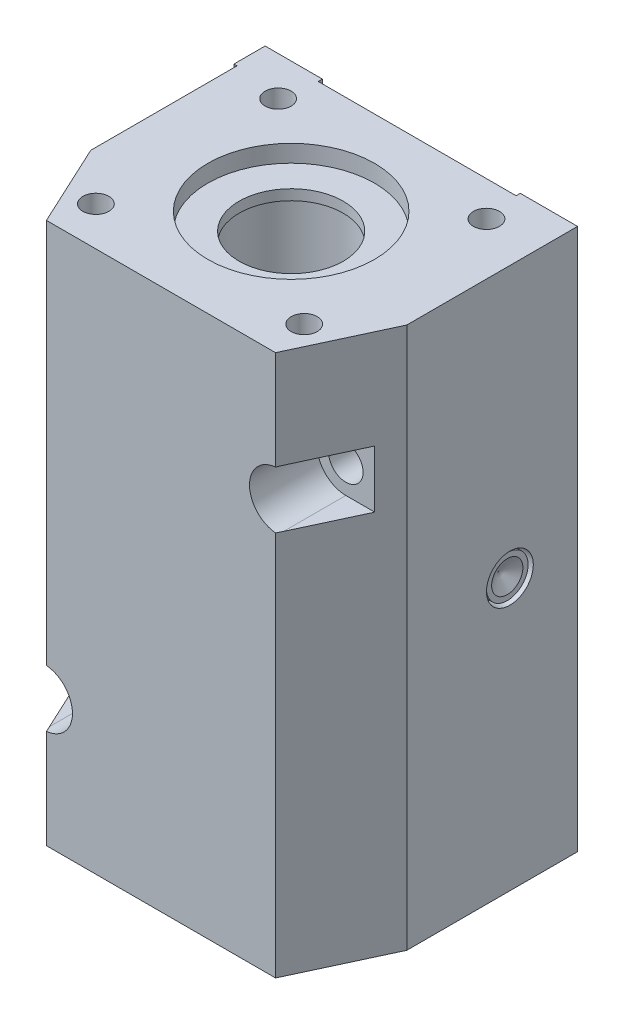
ISO-10303-21;
HEADER;
FILE_DESCRIPTION(('STEP AP214'),'2;1');
FILE_NAME('part.step','',(''),(''),'','','');
FILE_SCHEMA(('AUTOMOTIVE_DESIGN { 1 0 10303 214 1 1 1 1 }'));
ENDSEC;
DATA;
#1=APPLICATION_CONTEXT('core data for automotive mechanical design processes');
#2=APPLICATION_PROTOCOL_DEFINITION('international standard','automotive_design',2000,#1);
#3=PRODUCT_CONTEXT('',#1,'mechanical');
#4=PRODUCT('Part','Part','',(#3));
#5=PRODUCT_RELATED_PRODUCT_CATEGORY('part','',(#4));
#6=PRODUCT_DEFINITION_FORMATION('','',#4);
#7=PRODUCT_DEFINITION_CONTEXT('part definition',#1,'design');
#8=PRODUCT_DEFINITION('design','',#6,#7);
#9=PRODUCT_DEFINITION_SHAPE('','',#8);
#10=(LENGTH_UNIT() NAMED_UNIT(*) SI_UNIT(.MILLI.,.METRE.));
#11=(NAMED_UNIT(*) PLANE_ANGLE_UNIT() SI_UNIT($,.RADIAN.));
#12=(NAMED_UNIT(*) SI_UNIT($,.STERADIAN.) SOLID_ANGLE_UNIT());
#13=UNCERTAINTY_MEASURE_WITH_UNIT(LENGTH_MEASURE(1.E-05),#10,'distance_accuracy_value','');
#14=(GEOMETRIC_REPRESENTATION_CONTEXT(3) GLOBAL_UNCERTAINTY_ASSIGNED_CONTEXT((#13)) GLOBAL_UNIT_ASSIGNED_CONTEXT((#10,
#11,#12)) REPRESENTATION_CONTEXT('',''));
#15=CARTESIAN_POINT('',(0.,0.,0.));
#16=DIRECTION('',(0.,0.,1.));
#17=DIRECTION('',(1.,0.,0.));
#18=AXIS2_PLACEMENT_3D('',#15,#16,#17);
#19=CARTESIAN_POINT('',(0.,5.70000000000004,0.));
#20=DIRECTION('',(0.,1.,0.));
#21=DIRECTION('',(0.,0.,1.00000000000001));
#22=AXIS2_PLACEMENT_3D('',#19,#20,#21);
#23=CYLINDRICAL_SURFACE('',#22,10.5);
#24=CARTESIAN_POINT('',(0.,5.70000000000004,0.));
#25=DIRECTION('',(0.,1.,0.));
#26=DIRECTION('',(0.,0.,-1.00000000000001));
#27=AXIS2_PLACEMENT_3D('',#24,#25,#26);
#28=CIRCLE('',#27,10.5);
#29=CARTESIAN_POINT('',(0.,5.70000000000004,-10.5000000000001));
#30=VERTEX_POINT('',#29);
#31=EDGE_CURVE('E1473',#30,#30,#28,.T.);
#32=ORIENTED_EDGE('',*,*,#31,.F.);
#33=EDGE_LOOP('',(#32));
#34=FACE_BOUND('',#33,.T.);
#35=CARTESIAN_POINT('',(-8.88178419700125E-13,46.7,0.));
#36=DIRECTION('',(0.,1.,0.));
#37=DIRECTION('',(0.,0.,-1.00000000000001));
#38=AXIS2_PLACEMENT_3D('',#35,#36,#37);
#39=CIRCLE('',#38,10.5);
#40=CARTESIAN_POINT('',(-8.88178419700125E-13,46.7,-10.5000000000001));
#41=VERTEX_POINT('',#40);
#42=EDGE_CURVE('E1470',#41,#41,#39,.T.);
#43=ORIENTED_EDGE('',*,*,#42,.T.);
#44=EDGE_LOOP('',(#43));
#45=FACE_BOUND('',#44,.T.);
#46=ADVANCED_FACE('F44',(#34,#45),#23,.F.);
#47=CARTESIAN_POINT('',(0.,5.70000000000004,0.));
#48=DIRECTION('',(0.,-1.,0.));
#49=DIRECTION('',(0.,0.,-1.00000000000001));
#50=AXIS2_PLACEMENT_3D('',#47,#48,#49);
#51=PLANE('',#50);
#52=CARTESIAN_POINT('',(0.,5.70000000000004,0.));
#53=DIRECTION('',(0.,-1.,0.));
#54=DIRECTION('',(0.,0.,-1.00000000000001));
#55=AXIS2_PLACEMENT_3D('',#52,#53,#54);
#56=CIRCLE('',#55,10.);
#57=CARTESIAN_POINT('',(0.,5.70000000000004,-10.0000000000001));
#58=VERTEX_POINT('',#57);
#59=EDGE_CURVE('E279',#58,#58,#56,.T.);
#60=ORIENTED_EDGE('',*,*,#59,.T.);
#61=EDGE_LOOP('',(#60));
#62=FACE_BOUND('',#61,.T.);
#63=ORIENTED_EDGE('',*,*,#31,.T.);
#64=EDGE_LOOP('',(#63));
#65=FACE_BOUND('',#64,.T.);
#66=ADVANCED_FACE('F453',(#62,#65),#51,.F.);
#67=CARTESIAN_POINT('',(-8.88178419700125E-13,46.7,0.));
#68=DIRECTION('',(0.,-1.,0.));
#69=DIRECTION('',(0.,0.,-1.00000000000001));
#70=AXIS2_PLACEMENT_3D('',#67,#68,#69);
#71=PLANE('',#70);
#72=CARTESIAN_POINT('',(-8.88178419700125E-13,46.7,0.));
#73=DIRECTION('',(0.,-1.,0.));
#74=DIRECTION('',(1.00000000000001,0.,0.));
#75=AXIS2_PLACEMENT_3D('',#72,#73,#74);
#76=CIRCLE('',#75,10.);
#77=CARTESIAN_POINT('',(9.99999999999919,46.7,0.));
#78=VERTEX_POINT('',#77);
#79=EDGE_CURVE('E953',#78,#78,#76,.T.);
#80=ORIENTED_EDGE('',*,*,#79,.F.);
#81=EDGE_LOOP('',(#80));
#82=FACE_BOUND('',#81,.T.);
#83=ORIENTED_EDGE('',*,*,#42,.F.);
#84=EDGE_LOOP('',(#83));
#85=FACE_BOUND('',#84,.T.);
#86=ADVANCED_FACE('F459',(#82,#85),#71,.T.);
#87=CARTESIAN_POINT('',(-8.88178419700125E-13,52.,0.));
#88=DIRECTION('',(0.,-1.,0.));
#89=DIRECTION('',(1.00000000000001,0.,0.));
#90=AXIS2_PLACEMENT_3D('',#87,#88,#89);
#91=CYLINDRICAL_SURFACE('',#90,16.);
#92=CARTESIAN_POINT('',(-8.88178419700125E-13,52.,0.));
#93=DIRECTION('',(0.,-1.,0.));
#94=DIRECTION('',(1.00000000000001,0.,0.));
#95=AXIS2_PLACEMENT_3D('',#92,#93,#94);
#96=CIRCLE('',#95,16.);
#97=CARTESIAN_POINT('',(15.9999999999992,52.,0.));
#98=VERTEX_POINT('',#97);
#99=EDGE_CURVE('E951',#98,#98,#96,.T.);
#100=ORIENTED_EDGE('',*,*,#99,.F.);
#101=EDGE_LOOP('',(#100));
#102=FACE_BOUND('',#101,.T.);
#103=CARTESIAN_POINT('',(-8.88178419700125E-13,48.7,0.));
#104=DIRECTION('',(0.,-1.,0.));
#105=DIRECTION('',(1.00000000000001,0.,0.));
#106=AXIS2_PLACEMENT_3D('',#103,#104,#105);
#107=CIRCLE('',#106,16.);
#108=CARTESIAN_POINT('',(15.9999999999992,48.7,0.));
#109=VERTEX_POINT('',#108);
#110=EDGE_CURVE('E332',#109,#109,#107,.T.);
#111=ORIENTED_EDGE('',*,*,#110,.T.);
#112=EDGE_LOOP('',(#111));
#113=FACE_BOUND('',#112,.T.);
#114=ADVANCED_FACE('F1439',(#102,#113),#91,.F.);
#115=CARTESIAN_POINT('',(-8.88178419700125E-13,52.,0.));
#116=DIRECTION('',(0.,-1.,0.));
#117=DIRECTION('',(1.00000000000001,0.,0.));
#118=AXIS2_PLACEMENT_3D('',#115,#116,#117);
#119=CYLINDRICAL_SURFACE('',#118,10.);
#120=CARTESIAN_POINT('',(-8.88178419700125E-13,48.7,0.));
#121=DIRECTION('',(0.,-1.,0.));
#122=DIRECTION('',(1.00000000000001,0.,0.));
#123=AXIS2_PLACEMENT_3D('',#120,#121,#122);
#124=CIRCLE('',#123,10.);
#125=CARTESIAN_POINT('',(9.99999999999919,48.7,0.));
#126=VERTEX_POINT('',#125);
#127=EDGE_CURVE('E1447',#126,#126,#124,.T.);
#128=ORIENTED_EDGE('',*,*,#127,.F.);
#129=EDGE_LOOP('',(#128));
#130=FACE_BOUND('',#129,.T.);
#131=ORIENTED_EDGE('',*,*,#79,.T.);
#132=EDGE_LOOP('',(#131));
#133=FACE_BOUND('',#132,.T.);
#134=ADVANCED_FACE('F1442',(#130,#133),#119,.F.);
#135=CARTESIAN_POINT('',(10.0000000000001,48.7,0.));
#136=DIRECTION('',(0.,-1.,0.));
#137=DIRECTION('',(1.00000000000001,0.,0.));
#138=AXIS2_PLACEMENT_3D('',#135,#136,#137);
#139=PLANE('',#138);
#140=ORIENTED_EDGE('',*,*,#110,.F.);
#141=EDGE_LOOP('',(#140));
#142=FACE_BOUND('',#141,.T.);
#143=ORIENTED_EDGE('',*,*,#127,.T.);
#144=EDGE_LOOP('',(#143));
#145=FACE_BOUND('',#144,.T.);
#146=ADVANCED_FACE('F403',(#142,#145),#139,.F.);
#147=CARTESIAN_POINT('',(19.0000000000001,51.9999999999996,-24.2000000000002));
#148=DIRECTION('',(0.,0.,-1.00000000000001));
#149=DIRECTION('',(0.,1.,0.));
#150=AXIS2_PLACEMENT_3D('',#147,#148,#149);
#151=PLANE('',#150);
#152=DIRECTION('',(1.00000000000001,0.,0.));
#153=VECTOR('',#152,1.);
#154=CARTESIAN_POINT('',(-8.88178419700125E-13,51.9999999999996,-24.2000000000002));
#155=LINE('',#154,#153);
#156=CARTESIAN_POINT('',(19.0000000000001,51.9999999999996,-24.2000000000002));
#157=VERTEX_POINT('',#156);
#158=CARTESIAN_POINT('',(-19.000000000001,51.9999999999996,-24.2000000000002));
#159=VERTEX_POINT('',#158);
#160=EDGE_CURVE('E700',#157,#159,#155,.F.);
#161=ORIENTED_EDGE('',*,*,#160,.F.);
#162=DIRECTION('',(0.,1.,0.));
#163=VECTOR('',#162,1.);
#164=CARTESIAN_POINT('',(19.0000000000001,51.9999999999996,-24.2000000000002));
#165=LINE('',#164,#163);
#166=CARTESIAN_POINT('',(19.,-51.9999999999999,-24.2000000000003));
#167=VERTEX_POINT('',#166);
#168=EDGE_CURVE('E503',#167,#157,#165,.T.);
#169=ORIENTED_EDGE('',*,*,#168,.F.);
#170=DIRECTION('',(1.00000000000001,0.,0.));
#171=VECTOR('',#170,1.);
#172=CARTESIAN_POINT('',(0.,-51.9999999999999,-24.2000000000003));
#173=LINE('',#172,#171);
#174=CARTESIAN_POINT('',(-19.0000000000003,-51.9999999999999,-24.2000000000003));
#175=VERTEX_POINT('',#174);
#176=EDGE_CURVE('E695',#167,#175,#173,.F.);
#177=ORIENTED_EDGE('',*,*,#176,.T.);
#178=DIRECTION('',(0.,1.,0.));
#179=VECTOR('',#178,1.);
#180=CARTESIAN_POINT('',(-19.000000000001,51.9999999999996,-24.2000000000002));
#181=LINE('',#180,#179);
#182=EDGE_CURVE('E755',#175,#159,#181,.T.);
#183=ORIENTED_EDGE('',*,*,#182,.T.);
#184=EDGE_LOOP('',(#161,#169,#177,#183));
#185=FACE_BOUND('',#184,.T.);
#186=ADVANCED_FACE('F399',(#185),#151,.T.);
#187=CARTESIAN_POINT('',(0.,-52.,0.));
#188=DIRECTION('',(0.,1.,0.));
#189=DIRECTION('',(0.,0.,1.00000000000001));
#190=AXIS2_PLACEMENT_3D('',#187,#188,#189);
#191=PLANE('',#190);
#192=CARTESIAN_POINT('',(0.,-52.,0.));
#193=DIRECTION('',(0.,-1.,0.));
#194=DIRECTION('',(0.,0.,-1.00000000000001));
#195=AXIS2_PLACEMENT_3D('',#192,#193,#194);
#196=CIRCLE('',#195,16.);
#197=CARTESIAN_POINT('',(0.,-52.,-16.0000000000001));
#198=VERTEX_POINT('',#197);
#199=EDGE_CURVE('E263',#198,#198,#196,.T.);
#200=ORIENTED_EDGE('',*,*,#199,.F.);
#201=EDGE_LOOP('',(#200));
#202=FACE_BOUND('',#201,.T.);
#203=ORIENTED_EDGE('',*,*,#176,.F.);
#204=DIRECTION('',(0.,0.,1.00000000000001));
#205=VECTOR('',#204,1.);
#206=CARTESIAN_POINT('',(19.,-51.9999999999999,-25.0000000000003));
#207=LINE('',#206,#205);
#208=CARTESIAN_POINT('',(19.,-51.9999999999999,-25.0000000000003));
#209=VERTEX_POINT('',#208);
#210=EDGE_CURVE('E544',#209,#167,#207,.T.);
#211=ORIENTED_EDGE('',*,*,#210,.F.);
#212=DIRECTION('',(-1.00000000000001,0.,0.));
#213=VECTOR('',#212,1.);
#214=CARTESIAN_POINT('',(19.,-51.9999999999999,-25.0000000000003));
#215=LINE('',#214,#213);
#216=CARTESIAN_POINT('',(30.,-51.9999999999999,-25.0000000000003));
#217=VERTEX_POINT('',#216);
#218=EDGE_CURVE('E542',#217,#209,#215,.T.);
#219=ORIENTED_EDGE('',*,*,#218,.F.);
#220=DIRECTION('',(0.,0.,1.00000000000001));
#221=VECTOR('',#220,1.);
#222=CARTESIAN_POINT('',(30.,-52.,0.));
#223=LINE('',#222,#221);
#224=CARTESIAN_POINT('',(30.,-52.,7.80000000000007));
#225=VERTEX_POINT('',#224);
#226=EDGE_CURVE('E787',#225,#217,#223,.F.);
#227=ORIENTED_EDGE('',*,*,#226,.F.);
#228=DIRECTION('',(0.421730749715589,0.,-0.906721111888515));
#229=VECTOR('',#228,1.);
#230=CARTESIAN_POINT('',(22.,-52.,25.0000000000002));
#231=LINE('',#230,#229);
#232=CARTESIAN_POINT('',(22.,-52.,25.0000000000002));
#233=VERTEX_POINT('',#232);
#234=EDGE_CURVE('E653',#233,#225,#231,.T.);
#235=ORIENTED_EDGE('',*,*,#234,.F.);
#236=DIRECTION('',(1.00000000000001,0.,0.));
#237=VECTOR('',#236,1.);
#238=CARTESIAN_POINT('',(-22.0000000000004,-52.,25.0000000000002));
#239=LINE('',#238,#237);
#240=CARTESIAN_POINT('',(-22.0000000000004,-52.,25.0000000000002));
#241=VERTEX_POINT('',#240);
#242=EDGE_CURVE('E624',#241,#233,#239,.T.);
#243=ORIENTED_EDGE('',*,*,#242,.F.);
#244=DIRECTION('',(0.421730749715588,0.,0.906721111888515));
#245=VECTOR('',#244,1.);
#246=CARTESIAN_POINT('',(-29.4000000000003,-52.,9.09000000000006));
#247=LINE('',#246,#245);
#248=CARTESIAN_POINT('',(-29.4000000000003,-52.,9.09000000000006));
#249=VERTEX_POINT('',#248);
#250=EDGE_CURVE('E665',#249,#241,#247,.T.);
#251=ORIENTED_EDGE('',*,*,#250,.F.);
#252=DIRECTION('',(0.,0.,1.00000000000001));
#253=VECTOR('',#252,1.);
#254=CARTESIAN_POINT('',(-29.4000000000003,-52.,0.));
#255=LINE('',#254,#253);
#256=CARTESIAN_POINT('',(-29.4000000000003,-51.9999999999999,-19.0000000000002));
#257=VERTEX_POINT('',#256);
#258=EDGE_CURVE('E511',#257,#249,#255,.T.);
#259=ORIENTED_EDGE('',*,*,#258,.F.);
#260=DIRECTION('',(1.00000000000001,0.,0.));
#261=VECTOR('',#260,1.);
#262=CARTESIAN_POINT('',(-30.0000000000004,-51.9999999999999,-19.0000000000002));
#263=LINE('',#262,#261);
#264=CARTESIAN_POINT('',(-30.0000000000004,-51.9999999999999,-19.0000000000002));
#265=VERTEX_POINT('',#264);
#266=EDGE_CURVE('E488',#265,#257,#263,.T.);
#267=ORIENTED_EDGE('',*,*,#266,.F.);
#268=DIRECTION('',(0.,0.,1.00000000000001));
#269=VECTOR('',#268,1.);
#270=CARTESIAN_POINT('',(-30.0000000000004,-51.9999999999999,-19.0000000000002));
#271=LINE('',#270,#269);
#272=CARTESIAN_POINT('',(-30.0000000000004,-51.9999999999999,-25.0000000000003));
#273=VERTEX_POINT('',#272);
#274=EDGE_CURVE('E521',#273,#265,#271,.T.);
#275=ORIENTED_EDGE('',*,*,#274,.F.);
#276=DIRECTION('',(1.00000000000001,0.,0.));
#277=VECTOR('',#276,1.);
#278=CARTESIAN_POINT('',(0.,-51.9999999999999,-25.0000000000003));
#279=LINE('',#278,#277);
#280=CARTESIAN_POINT('',(-19.0000000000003,-51.9999999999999,-25.0000000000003));
#281=VERTEX_POINT('',#280);
#282=EDGE_CURVE('E699',#281,#273,#279,.F.);
#283=ORIENTED_EDGE('',*,*,#282,.F.);
#284=DIRECTION('',(0.,0.,1.00000000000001));
#285=VECTOR('',#284,1.);
#286=CARTESIAN_POINT('',(-19.0000000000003,-51.9999999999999,-24.2000000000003));
#287=LINE('',#286,#285);
#288=EDGE_CURVE('E558',#175,#281,#287,.F.);
#289=ORIENTED_EDGE('',*,*,#288,.F.);
#290=EDGE_LOOP('',(#203,#211,#219,#227,#235,#243,#251,#259,#267,#275,#283,#289));
#291=FACE_BOUND('',#290,.T.);
#292=ADVANCED_FACE('F402',(#202,#291),#191,.F.);
#293=CARTESIAN_POINT('',(-8.88178419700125E-13,52.,0.));
#294=DIRECTION('',(0.,1.,0.));
#295=DIRECTION('',(0.,0.,1.00000000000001));
#296=AXIS2_PLACEMENT_3D('',#293,#294,#295);
#297=PLANE('',#296);
#298=CARTESIAN_POINT('',(20.0000000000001,52.,-17.5000000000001));
#299=DIRECTION('',(0.,1.,0.));
#300=DIRECTION('',(0.,0.,1.00000000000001));
#301=AXIS2_PLACEMENT_3D('',#298,#299,#300);
#302=CIRCLE('',#301,2.49999999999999);
#303=CARTESIAN_POINT('',(20.0000000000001,52.,-15.0000000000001));
#304=VERTEX_POINT('',#303);
#305=EDGE_CURVE('E231',#304,#304,#302,.T.);
#306=ORIENTED_EDGE('',*,*,#305,.F.);
#307=EDGE_LOOP('',(#306));
#308=FACE_BOUND('',#307,.T.);
#309=CARTESIAN_POINT('',(20.,52.,17.5000000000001));
#310=DIRECTION('',(0.,1.,0.));
#311=DIRECTION('',(0.,0.,1.00000000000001));
#312=AXIS2_PLACEMENT_3D('',#309,#310,#311);
#313=CIRCLE('',#312,2.49999999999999);
#314=CARTESIAN_POINT('',(20.,52.,20.0000000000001));
#315=VERTEX_POINT('',#314);
#316=EDGE_CURVE('E243',#315,#315,#313,.T.);
#317=ORIENTED_EDGE('',*,*,#316,.F.);
#318=EDGE_LOOP('',(#317));
#319=FACE_BOUND('',#318,.T.);
#320=CARTESIAN_POINT('',(-20.000000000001,52.,17.5000000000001));
#321=DIRECTION('',(0.,1.,0.));
#322=DIRECTION('',(0.,0.,1.00000000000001));
#323=AXIS2_PLACEMENT_3D('',#320,#321,#322);
#324=CIRCLE('',#323,2.49999999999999);
#325=CARTESIAN_POINT('',(-20.000000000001,52.,20.0000000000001));
#326=VERTEX_POINT('',#325);
#327=EDGE_CURVE('E251',#326,#326,#324,.T.);
#328=ORIENTED_EDGE('',*,*,#327,.F.);
#329=EDGE_LOOP('',(#328));
#330=FACE_BOUND('',#329,.T.);
#331=CARTESIAN_POINT('',(-20.000000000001,52.,-17.5000000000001));
#332=DIRECTION('',(0.,1.,0.));
#333=DIRECTION('',(0.,0.,1.00000000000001));
#334=AXIS2_PLACEMENT_3D('',#331,#332,#333);
#335=CIRCLE('',#334,2.49999999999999);
#336=CARTESIAN_POINT('',(-20.000000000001,52.,-15.0000000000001));
#337=VERTEX_POINT('',#336);
#338=EDGE_CURVE('E259',#337,#337,#335,.T.);
#339=ORIENTED_EDGE('',*,*,#338,.F.);
#340=EDGE_LOOP('',(#339));
#341=FACE_BOUND('',#340,.T.);
#342=ORIENTED_EDGE('',*,*,#99,.T.);
#343=EDGE_LOOP('',(#342));
#344=FACE_BOUND('',#343,.T.);
#345=DIRECTION('',(0.,0.,1.00000000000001));
#346=VECTOR('',#345,1.);
#347=CARTESIAN_POINT('',(30.0000000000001,52.,0.));
#348=LINE('',#347,#346);
#349=CARTESIAN_POINT('',(30.0000000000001,52.,7.80000000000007));
#350=VERTEX_POINT('',#349);
#351=CARTESIAN_POINT('',(30.0000000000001,51.9999999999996,-25.0000000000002));
#352=VERTEX_POINT('',#351);
#353=EDGE_CURVE('E650',#350,#352,#348,.F.);
#354=ORIENTED_EDGE('',*,*,#353,.T.);
#355=DIRECTION('',(1.00000000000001,0.,0.));
#356=VECTOR('',#355,1.);
#357=CARTESIAN_POINT('',(30.0000000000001,51.9999999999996,-25.0000000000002));
#358=LINE('',#357,#356);
#359=CARTESIAN_POINT('',(19.0000000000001,51.9999999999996,-25.0000000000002));
#360=VERTEX_POINT('',#359);
#361=EDGE_CURVE('E534',#360,#352,#358,.T.);
#362=ORIENTED_EDGE('',*,*,#361,.F.);
#363=DIRECTION('',(0.,0.,1.00000000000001));
#364=VECTOR('',#363,1.);
#365=CARTESIAN_POINT('',(19.0000000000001,51.9999999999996,-25.0000000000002));
#366=LINE('',#365,#364);
#367=EDGE_CURVE('E548',#360,#157,#366,.T.);
#368=ORIENTED_EDGE('',*,*,#367,.T.);
#369=ORIENTED_EDGE('',*,*,#160,.T.);
#370=DIRECTION('',(0.,0.,1.00000000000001));
#371=VECTOR('',#370,1.);
#372=CARTESIAN_POINT('',(-19.000000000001,51.9999999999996,-24.2000000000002));
#373=LINE('',#372,#371);
#374=CARTESIAN_POINT('',(-19.000000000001,51.9999999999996,-25.0000000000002));
#375=VERTEX_POINT('',#374);
#376=EDGE_CURVE('E372',#375,#159,#373,.T.);
#377=ORIENTED_EDGE('',*,*,#376,.F.);
#378=DIRECTION('',(1.00000000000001,0.,0.));
#379=VECTOR('',#378,1.);
#380=CARTESIAN_POINT('',(-8.88178419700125E-13,51.9999999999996,-25.0000000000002));
#381=LINE('',#380,#379);
#382=CARTESIAN_POINT('',(-30.000000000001,51.9999999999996,-25.0000000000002));
#383=VERTEX_POINT('',#382);
#384=EDGE_CURVE('E694',#375,#383,#381,.F.);
#385=ORIENTED_EDGE('',*,*,#384,.T.);
#386=DIRECTION('',(0.,0.,-1.00000000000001));
#387=VECTOR('',#386,1.);
#388=CARTESIAN_POINT('',(-30.000000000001,51.9999999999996,-25.0000000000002));
#389=LINE('',#388,#387);
#390=CARTESIAN_POINT('',(-30.000000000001,52.,-19.0000000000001));
#391=VERTEX_POINT('',#390);
#392=EDGE_CURVE('E497',#391,#383,#389,.T.);
#393=ORIENTED_EDGE('',*,*,#392,.F.);
#394=DIRECTION('',(1.00000000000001,0.,0.));
#395=VECTOR('',#394,1.);
#396=CARTESIAN_POINT('',(-30.000000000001,52.,-19.0000000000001));
#397=LINE('',#396,#395);
#398=CARTESIAN_POINT('',(-29.400000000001,52.,-19.0000000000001));
#399=VERTEX_POINT('',#398);
#400=EDGE_CURVE('E485',#391,#399,#397,.T.);
#401=ORIENTED_EDGE('',*,*,#400,.T.);
#402=DIRECTION('',(0.,0.,1.00000000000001));
#403=VECTOR('',#402,1.);
#404=CARTESIAN_POINT('',(-29.400000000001,52.,0.));
#405=LINE('',#404,#403);
#406=CARTESIAN_POINT('',(-29.400000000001,52.,9.09000000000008));
#407=VERTEX_POINT('',#406);
#408=EDGE_CURVE('E494',#399,#407,#405,.T.);
#409=ORIENTED_EDGE('',*,*,#408,.T.);
#410=DIRECTION('',(0.421730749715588,0.,0.906721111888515));
#411=VECTOR('',#410,1.);
#412=CARTESIAN_POINT('',(-29.400000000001,52.,9.09000000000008));
#413=LINE('',#412,#411);
#414=CARTESIAN_POINT('',(-22.000000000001,52.,25.0000000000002));
#415=VERTEX_POINT('',#414);
#416=EDGE_CURVE('E633',#415,#407,#413,.F.);
#417=ORIENTED_EDGE('',*,*,#416,.F.);
#418=DIRECTION('',(1.00000000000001,0.,0.));
#419=VECTOR('',#418,1.);
#420=CARTESIAN_POINT('',(-22.000000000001,52.,25.0000000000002));
#421=LINE('',#420,#419);
#422=CARTESIAN_POINT('',(22.0000000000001,52.,25.0000000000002));
#423=VERTEX_POINT('',#422);
#424=EDGE_CURVE('E54',#423,#415,#421,.F.);
#425=ORIENTED_EDGE('',*,*,#424,.F.);
#426=DIRECTION('',(0.421730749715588,0.,-0.906721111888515));
#427=VECTOR('',#426,1.);
#428=CARTESIAN_POINT('',(22.0000000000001,52.,25.0000000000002));
#429=LINE('',#428,#427);
#430=EDGE_CURVE('E646',#423,#350,#429,.T.);
#431=ORIENTED_EDGE('',*,*,#430,.T.);
#432=EDGE_LOOP('',(#354,#362,#368,#369,#377,#385,#393,#401,#409,#417,#425,#431));
#433=FACE_BOUND('',#432,.T.);
#434=ADVANCED_FACE('F411',(#308,#319,#330,#341,#344,#433),#297,.T.);
#435=CARTESIAN_POINT('',(30.0000000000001,52.,7.80000000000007));
#436=DIRECTION('',(1.00000000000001,0.,0.));
#437=DIRECTION('',(0.,1.,0.));
#438=AXIS2_PLACEMENT_3D('',#435,#436,#437);
#439=PLANE('',#438);
#440=CARTESIAN_POINT('',(30.0000000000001,0.,-12.0000000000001));
#441=DIRECTION('',(1.00000000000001,0.,0.));
#442=DIRECTION('',(0.,0.,-1.00000000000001));
#443=AXIS2_PLACEMENT_3D('',#440,#441,#442);
#444=CIRCLE('',#443,4.50000000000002);
#445=CARTESIAN_POINT('',(30.0000000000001,0.,-16.5000000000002));
#446=VERTEX_POINT('',#445);
#447=EDGE_CURVE('E899',#446,#446,#444,.T.);
#448=ORIENTED_EDGE('',*,*,#447,.F.);
#449=EDGE_LOOP('',(#448));
#450=FACE_BOUND('',#449,.T.);
#451=ORIENTED_EDGE('',*,*,#226,.T.);
#452=DIRECTION('',(0.,-1.,0.));
#453=VECTOR('',#452,1.);
#454=CARTESIAN_POINT('',(30.,-51.9999999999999,-25.0000000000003));
#455=LINE('',#454,#453);
#456=EDGE_CURVE('E538',#352,#217,#455,.T.);
#457=ORIENTED_EDGE('',*,*,#456,.F.);
#458=ORIENTED_EDGE('',*,*,#353,.F.);
#459=DIRECTION('',(0.,1.,0.));
#460=VECTOR('',#459,1.);
#461=CARTESIAN_POINT('',(30.0000000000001,52.,7.80000000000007));
#462=LINE('',#461,#460);
#463=EDGE_CURVE('E657',#225,#350,#462,.T.);
#464=ORIENTED_EDGE('',*,*,#463,.F.);
#465=EDGE_LOOP('',(#451,#457,#458,#464));
#466=FACE_BOUND('',#465,.T.);
#467=ADVANCED_FACE('F407',(#450,#466),#439,.T.);
#468=CARTESIAN_POINT('',(-19.000000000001,51.9999999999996,-25.0000000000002));
#469=DIRECTION('',(0.,0.,-1.00000000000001));
#470=DIRECTION('',(-1.00000000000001,0.,0.));
#471=AXIS2_PLACEMENT_3D('',#468,#469,#470);
#472=PLANE('',#471);
#473=ORIENTED_EDGE('',*,*,#282,.T.);
#474=DIRECTION('',(0.,-1.,0.));
#475=VECTOR('',#474,1.);
#476=CARTESIAN_POINT('',(-30.0000000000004,-51.9999999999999,-25.0000000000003));
#477=LINE('',#476,#475);
#478=EDGE_CURVE('E490',#383,#273,#477,.T.);
#479=ORIENTED_EDGE('',*,*,#478,.F.);
#480=ORIENTED_EDGE('',*,*,#384,.F.);
#481=DIRECTION('',(0.,1.,0.));
#482=VECTOR('',#481,1.);
#483=CARTESIAN_POINT('',(-19.000000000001,51.9999999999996,-25.0000000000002));
#484=LINE('',#483,#482);
#485=CARTESIAN_POINT('',(-19.,-25.5655747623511,-24.9999999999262));
#486=VERTEX_POINT('',#485);
#487=EDGE_CURVE('E561',#375,#486,#484,.F.);
#488=ORIENTED_EDGE('',*,*,#487,.T.);
#489=CARTESIAN_POINT('',(-22.5000000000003,-27.5000000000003,-24.9999999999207));
#490=DIRECTION('',(0.,0.,-1.00000000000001));
#491=DIRECTION('',(0.,1.,0.));
#492=AXIS2_PLACEMENT_3D('',#489,#490,#491);
#493=CIRCLE('',#492,3.99900000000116);
#494=CARTESIAN_POINT('',(-26.4990000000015,-27.5000000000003,-24.9999999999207));
#495=VERTEX_POINT('',#494);
#496=EDGE_CURVE('E374',#486,#495,#493,.F.);
#497=ORIENTED_EDGE('',*,*,#496,.T.);
#498=CARTESIAN_POINT('',(-22.5000000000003,-27.5000000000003,-24.9999999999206));
#499=DIRECTION('',(0.,0.,-1.00000000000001));
#500=DIRECTION('',(0.,1.,0.));
#501=AXIS2_PLACEMENT_3D('',#498,#499,#500);
#502=CIRCLE('',#501,3.99900000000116);
#503=CARTESIAN_POINT('',(-19.0000000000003,-29.4344252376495,-24.9999999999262));
#504=VERTEX_POINT('',#503);
#505=EDGE_CURVE('E572',#495,#504,#502,.F.);
#506=ORIENTED_EDGE('',*,*,#505,.T.);
#507=DIRECTION('',(0.,1.,0.));
#508=VECTOR('',#507,1.);
#509=CARTESIAN_POINT('',(-19.000000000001,51.9999999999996,-25.0000000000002));
#510=LINE('',#509,#508);
#511=EDGE_CURVE('E566',#504,#281,#510,.F.);
#512=ORIENTED_EDGE('',*,*,#511,.T.);
#513=EDGE_LOOP('',(#473,#479,#480,#488,#497,#506,#512));
#514=FACE_BOUND('',#513,.T.);
#515=ADVANCED_FACE('F350',(#514),#472,.T.);
#516=CARTESIAN_POINT('',(-22.5000000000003,-27.5000000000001,-15.6520000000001));
#517=DIRECTION('',(0.,0.,1.00000000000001));
#518=DIRECTION('',(1.00000000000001,0.,0.));
#519=AXIS2_PLACEMENT_3D('',#516,#517,#518);
#520=CYLINDRICAL_SURFACE('',#519,3.302);
#521=CARTESIAN_POINT('',(-22.5000000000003,-27.5000000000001,-7.00100000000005));
#522=DIRECTION('',(0.,0.,1.00000000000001));
#523=DIRECTION('',(1.00000000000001,0.,0.));
#524=AXIS2_PLACEMENT_3D('',#521,#522,#523);
#525=CIRCLE('',#524,3.302);
#526=CARTESIAN_POINT('',(-19.1980000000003,-27.5000000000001,-7.00100000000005));
#527=VERTEX_POINT('',#526);
#528=EDGE_CURVE('E552',#527,#527,#525,.T.);
#529=ORIENTED_EDGE('',*,*,#528,.T.);
#530=EDGE_LOOP('',(#529));
#531=FACE_BOUND('',#530,.T.);
#532=CARTESIAN_POINT('',(-22.5000000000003,-27.5000000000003,-24.3029999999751));
#533=DIRECTION('',(0.,0.,-1.00000000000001));
#534=DIRECTION('',(-1.00000000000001,0.,0.));
#535=AXIS2_PLACEMENT_3D('',#532,#533,#534);
#536=CIRCLE('',#535,3.30200000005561);
#537=CARTESIAN_POINT('',(-25.8020000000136,-27.5000000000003,-24.3029999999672));
#538=VERTEX_POINT('',#537);
#539=CARTESIAN_POINT('',(-19.1980000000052,-27.5000000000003,-24.3029999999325));
#540=VERTEX_POINT('',#539);
#541=EDGE_CURVE('E713',#538,#540,#536,.T.);
#542=ORIENTED_EDGE('',*,*,#541,.T.);
#543=CARTESIAN_POINT('',(-22.5000000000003,-27.5000000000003,-24.3029999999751));
#544=DIRECTION('',(0.,0.,-1.00000000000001));
#545=DIRECTION('',(-1.00000000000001,0.,0.));
#546=AXIS2_PLACEMENT_3D('',#543,#544,#545);
#547=CIRCLE('',#546,3.30200000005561);
#548=EDGE_CURVE('E712',#540,#538,#547,.T.);
#549=ORIENTED_EDGE('',*,*,#548,.T.);
#550=EDGE_LOOP('',(#542,#549));
#551=FACE_BOUND('',#550,.T.);
#552=ADVANCED_FACE('F345',(#531,#551),#520,.F.);
#553=CARTESIAN_POINT('',(-25.8010000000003,-27.5000000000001,-7.00100000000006));
#554=DIRECTION('',(0.,0.,1.00000000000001));
#555=DIRECTION('',(0.,-1.,0.));
#556=AXIS2_PLACEMENT_3D('',#553,#554,#555);
#557=PLANE('',#556);
#558=CARTESIAN_POINT('',(-22.5000000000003,-27.5000000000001,-7.00100000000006));
#559=DIRECTION('',(0.,0.,1.00000000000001));
#560=DIRECTION('',(1.00000000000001,0.,0.));
#561=AXIS2_PLACEMENT_3D('',#558,#559,#560);
#562=CIRCLE('',#561,3.30000000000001);
#563=CARTESIAN_POINT('',(-19.2000000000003,-27.5000000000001,-7.00100000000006));
#564=VERTEX_POINT('',#563);
#565=EDGE_CURVE('E491',#564,#564,#562,.T.);
#566=ORIENTED_EDGE('',*,*,#565,.T.);
#567=EDGE_LOOP('',(#566));
#568=FACE_BOUND('',#567,.T.);
#569=ORIENTED_EDGE('',*,*,#528,.F.);
#570=EDGE_LOOP('',(#569));
#571=FACE_BOUND('',#570,.T.);
#572=ADVANCED_FACE('F349',(#568,#571),#557,.F.);
#573=CARTESIAN_POINT('',(-22.5000000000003,-27.5000000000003,-24.9999999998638));
#574=DIRECTION('',(0.,0.,-1.00000000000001));
#575=DIRECTION('',(0.,1.,0.));
#576=AXIS2_PLACEMENT_3D('',#573,#574,#575);
#577=CONICAL_SURFACE('',#576,3.99899999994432,0.785398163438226);
#578=ORIENTED_EDGE('',*,*,#496,.F.);
#579=CARTESIAN_POINT('',(-19.0000000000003,-27.5000000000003,-24.5009999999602));
#580=CARTESIAN_POINT('',(-19.0000000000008,-27.4462535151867,-24.500995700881));
#581=CARTESIAN_POINT('',(-19.0000000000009,-27.3925150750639,-24.5022386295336));
#582=CARTESIAN_POINT('',(-19.0000000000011,-27.2851592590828,-24.5071784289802));
#583=CARTESIAN_POINT('',(-19.000000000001,-27.2315418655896,-24.5108749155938));
#584=CARTESIAN_POINT('',(-19.0000000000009,-27.0712107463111,-24.5255655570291));
#585=CARTESIAN_POINT('',(-19.0000000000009,-26.9648091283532,-24.5401612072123));
#586=CARTESIAN_POINT('',(-19.0000000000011,-26.7551985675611,-24.5779036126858));
#587=CARTESIAN_POINT('',(-19.0000000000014,-26.6519656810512,-24.6009209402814));
#588=CARTESIAN_POINT('',(-19.0000000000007,-26.4474613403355,-24.6545042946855));
#589=CARTESIAN_POINT('',(-18.9999999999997,-26.3461904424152,-24.6850724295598));
#590=CARTESIAN_POINT('',(-19.0000000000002,-26.1880975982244,-24.7383936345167));
#591=CARTESIAN_POINT('',(-19.0000000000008,-26.130538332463,-24.7590073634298));
#592=CARTESIAN_POINT('',(-19.0000000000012,-26.016168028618,-24.8021780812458));
#593=CARTESIAN_POINT('',(-19.0000000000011,-25.9593568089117,-24.8247345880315));
#594=CARTESIAN_POINT('',(-19.000000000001,-25.8459605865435,-24.8718087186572));
#595=CARTESIAN_POINT('',(-19.0000000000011,-25.7893821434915,-24.8963420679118));
#596=CARTESIAN_POINT('',(-19.000000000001,-25.6769441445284,-24.9470130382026));
#597=CARTESIAN_POINT('',(-19.0000000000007,-25.6210846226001,-24.9731507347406));
#598=CARTESIAN_POINT('',(-19.,-25.5655747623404,-24.9999999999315));
#599=B_SPLINE_CURVE_WITH_KNOTS('',3,(#579,#580,#581,#582,#583,#584,#585,#586,#587,#588,#589,
#590,#591,#592,#593,#594,#595,#596,#597,#598),.UNSPECIFIED.,.F.,.F.,(4,2,2,2,2,2,2,2,2,4),(0.,
0.161209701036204,0.32239416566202,0.644138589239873,0.961132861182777,1.27821573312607,
1.46160249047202,1.64494386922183,1.82992382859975,2.0149124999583),.UNSPECIFIED.);
#600=CARTESIAN_POINT('',(-19.000000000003,-27.5000000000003,-24.5009999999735));
#601=VERTEX_POINT('',#600);
#602=EDGE_CURVE('E364',#601,#486,#599,.T.);
#603=ORIENTED_EDGE('',*,*,#602,.F.);
#604=DIRECTION('',(-0.707106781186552,0.,0.707106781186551));
#605=VECTOR('',#604,1.);
#606=CARTESIAN_POINT('',(498955.000000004,-27.4999999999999,-498998.501000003));
#607=LINE('',#606,#605);
#608=EDGE_CURVE('E708',#601,#540,#607,.T.);
#609=ORIENTED_EDGE('',*,*,#608,.T.);
#610=ORIENTED_EDGE('',*,*,#541,.F.);
#611=DIRECTION('',(0.707106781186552,0.,0.707106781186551));
#612=VECTOR('',#611,1.);
#613=CARTESIAN_POINT('',(-499000.000000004,-27.5000000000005,-498998.501000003));
#614=LINE('',#613,#612);
#615=EDGE_CURVE('E722',#538,#495,#614,.F.);
#616=ORIENTED_EDGE('',*,*,#615,.T.);
#617=EDGE_LOOP('',(#578,#603,#609,#610,#616));
#618=FACE_BOUND('',#617,.T.);
#619=ADVANCED_FACE('F354',(#618),#577,.F.);
#620=CARTESIAN_POINT('',(-22.5000000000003,-27.5000000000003,-24.9999999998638));
#621=DIRECTION('',(0.,0.,-1.00000000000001));
#622=DIRECTION('',(0.,1.,0.));
#623=AXIS2_PLACEMENT_3D('',#620,#621,#622);
#624=CONICAL_SURFACE('',#623,3.99899999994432,0.785398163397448);
#625=ORIENTED_EDGE('',*,*,#548,.F.);
#626=ORIENTED_EDGE('',*,*,#608,.F.);
#627=CARTESIAN_POINT('',(-19.0000000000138,-29.4344252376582,-24.9999999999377));
#628=CARTESIAN_POINT('',(-19.0000000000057,-29.2996952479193,-24.9348720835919));
#629=CARTESIAN_POINT('',(-19.0000000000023,-29.16274119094,-24.8737921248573));
#630=CARTESIAN_POINT('',(-18.9999999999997,-28.8836618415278,-24.7623790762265));
#631=CARTESIAN_POINT('',(-19.0000000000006,-28.741511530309,-24.7121092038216));
#632=CARTESIAN_POINT('',(-19.0000000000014,-28.4567804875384,-24.6269522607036));
#633=CARTESIAN_POINT('',(-19.0000000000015,-28.314316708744,-24.5916838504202));
#634=CARTESIAN_POINT('',(-19.0000000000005,-28.0265752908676,-24.5375870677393));
#635=CARTESIAN_POINT('',(-18.9999999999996,-27.8813066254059,-24.5187130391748));
#636=CARTESIAN_POINT('',(-19.0000000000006,-27.6963916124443,-24.5062856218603));
#637=CARTESIAN_POINT('',(-19.0000000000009,-27.6572258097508,-24.5043097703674));
#638=CARTESIAN_POINT('',(-19.0000000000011,-27.5787090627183,-24.5016651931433));
#639=CARTESIAN_POINT('',(-19.000000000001,-27.5393579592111,-24.5010011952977));
#640=CARTESIAN_POINT('',(-19.0000000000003,-27.5000000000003,-24.5009999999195));
#641=B_SPLINE_CURVE_WITH_KNOTS('',3,(#627,#628,#629,#630,#631,#632,#633,#634,#635,#636,#637,
#638,#639,#640),.UNSPECIFIED.,.F.,.F.,(4,2,2,2,2,2,4),(0.,0.449237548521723,0.901034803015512,
1.34053892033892,1.77881511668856,1.89644663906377,2.01450133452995),.UNSPECIFIED.);
#642=EDGE_CURVE('E373',#504,#601,#641,.T.);
#643=ORIENTED_EDGE('',*,*,#642,.F.);
#644=ORIENTED_EDGE('',*,*,#505,.F.);
#645=ORIENTED_EDGE('',*,*,#615,.F.);
#646=EDGE_LOOP('',(#625,#626,#643,#644,#645));
#647=FACE_BOUND('',#646,.T.);
#648=ADVANCED_FACE('F359',(#647),#624,.F.);
#649=CARTESIAN_POINT('',(-19.000000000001,51.9999999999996,-24.2000000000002));
#650=DIRECTION('',(1.00000000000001,0.,0.));
#651=DIRECTION('',(0.,1.,0.));
#652=AXIS2_PLACEMENT_3D('',#649,#650,#651);
#653=PLANE('',#652);
#654=ORIENTED_EDGE('',*,*,#288,.T.);
#655=ORIENTED_EDGE('',*,*,#511,.F.);
#656=ORIENTED_EDGE('',*,*,#642,.T.);
#657=ORIENTED_EDGE('',*,*,#602,.T.);
#658=ORIENTED_EDGE('',*,*,#487,.F.);
#659=ORIENTED_EDGE('',*,*,#376,.T.);
#660=ORIENTED_EDGE('',*,*,#182,.F.);
#661=EDGE_LOOP('',(#654,#655,#656,#657,#658,#659,#660));
#662=FACE_BOUND('',#661,.T.);
#663=ADVANCED_FACE('F380',(#662),#653,.T.);
#664=CARTESIAN_POINT('',(22.5,33.0000000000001,12.0000000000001));
#665=DIRECTION('',(0.,1.,0.));
#666=DIRECTION('',(0.,0.,1.00000000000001));
#667=AXIS2_PLACEMENT_3D('',#664,#665,#666);
#668=PLANE('',#667);
#669=DIRECTION('',(0.,0.,1.00000000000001));
#670=VECTOR('',#669,1.);
#671=CARTESIAN_POINT('',(22.5,33.0000000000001,12.0000000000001));
#672=LINE('',#671,#670);
#673=CARTESIAN_POINT('',(22.5,33.0000000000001,23.9250000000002));
#674=VERTEX_POINT('',#673);
#675=CARTESIAN_POINT('',(22.5,33.0000000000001,12.0000000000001));
#676=VERTEX_POINT('',#675);
#677=EDGE_CURVE('E746',#674,#676,#672,.F.);
#678=ORIENTED_EDGE('',*,*,#677,.T.);
#679=DIRECTION('',(1.00000000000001,0.,0.));
#680=VECTOR('',#679,1.);
#681=CARTESIAN_POINT('',(-9.43689570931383E-13,33.0000000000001,12.0000000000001));
#682=LINE('',#681,#680);
#683=CARTESIAN_POINT('',(28.0465116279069,32.9999999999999,12.0000000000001));
#684=VERTEX_POINT('',#683);
#685=EDGE_CURVE('E553',#684,#676,#682,.F.);
#686=ORIENTED_EDGE('',*,*,#685,.F.);
#687=DIRECTION('',(0.421730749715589,0.,-0.906721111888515));
#688=VECTOR('',#687,1.);
#689=CARTESIAN_POINT('',(22.0000000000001,33.0000000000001,25.0000000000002));
#690=LINE('',#689,#688);
#691=EDGE_CURVE('E589',#674,#684,#690,.T.);
#692=ORIENTED_EDGE('',*,*,#691,.F.);
#693=EDGE_LOOP('',(#678,#686,#692));
#694=FACE_BOUND('',#693,.T.);
#695=ADVANCED_FACE('F384',(#694),#668,.F.);
#696=CARTESIAN_POINT('',(0.,0.,12.0000000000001));
#697=DIRECTION('',(0.,0.,1.00000000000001));
#698=DIRECTION('',(0.,-1.,0.));
#699=AXIS2_PLACEMENT_3D('',#696,#697,#698);
#700=PLANE('',#699);
#701=CARTESIAN_POINT('',(22.5,27.5000000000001,12.0000000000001));
#702=DIRECTION('',(0.,0.,-1.00000000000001));
#703=DIRECTION('',(-1.00000000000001,0.,0.));
#704=AXIS2_PLACEMENT_3D('',#701,#702,#703);
#705=CIRCLE('',#704,3.30199999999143);
#706=CARTESIAN_POINT('',(19.1980000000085,27.5000000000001,12.0000000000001));
#707=VERTEX_POINT('',#706);
#708=EDGE_CURVE('E315',#707,#707,#705,.T.);
#709=ORIENTED_EDGE('',*,*,#708,.T.);
#710=EDGE_LOOP('',(#709));
#711=FACE_BOUND('',#710,.T.);
#712=CARTESIAN_POINT('',(22.5,27.5000000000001,12.0000000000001));
#713=DIRECTION('',(0.,0.,1.00000000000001));
#714=DIRECTION('',(1.00000000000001,0.,0.));
#715=AXIS2_PLACEMENT_3D('',#712,#713,#714);
#716=CIRCLE('',#715,5.5);
#717=CARTESIAN_POINT('',(22.5,22.,12.0000000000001));
#718=VERTEX_POINT('',#717);
#719=EDGE_CURVE('E743',#676,#718,#716,.T.);
#720=ORIENTED_EDGE('',*,*,#719,.T.);
#721=DIRECTION('',(1.00000000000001,0.,0.));
#722=VECTOR('',#721,1.);
#723=CARTESIAN_POINT('',(44.5,22.,12.0000000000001));
#724=LINE('',#723,#722);
#725=CARTESIAN_POINT('',(28.0465116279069,22.,12.0000000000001));
#726=VERTEX_POINT('',#725);
#727=EDGE_CURVE('E557',#718,#726,#724,.T.);
#728=ORIENTED_EDGE('',*,*,#727,.T.);
#729=DIRECTION('',(0.,1.,0.));
#730=VECTOR('',#729,1.);
#731=CARTESIAN_POINT('',(28.0465116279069,52.,12.0000000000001));
#732=LINE('',#731,#730);
#733=EDGE_CURVE('E586',#684,#726,#732,.F.);
#734=ORIENTED_EDGE('',*,*,#733,.F.);
#735=ORIENTED_EDGE('',*,*,#685,.T.);
#736=EDGE_LOOP('',(#720,#728,#734,#735));
#737=FACE_BOUND('',#736,.T.);
#738=ADVANCED_FACE('F389',(#711,#737),#700,.T.);
#739=CARTESIAN_POINT('',(44.5,22.,12.0000000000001));
#740=DIRECTION('',(0.,-1.,0.));
#741=DIRECTION('',(0.,0.,-1.00000000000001));
#742=AXIS2_PLACEMENT_3D('',#739,#740,#741);
#743=PLANE('',#742);
#744=ORIENTED_EDGE('',*,*,#727,.F.);
#745=DIRECTION('',(0.,0.,1.00000000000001));
#746=VECTOR('',#745,1.);
#747=CARTESIAN_POINT('',(22.5,22.,12.0000000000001));
#748=LINE('',#747,#746);
#749=CARTESIAN_POINT('',(22.5,22.,23.9250000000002));
#750=VERTEX_POINT('',#749);
#751=EDGE_CURVE('E742',#718,#750,#748,.T.);
#752=ORIENTED_EDGE('',*,*,#751,.T.);
#753=DIRECTION('',(0.421730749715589,0.,-0.906721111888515));
#754=VECTOR('',#753,1.);
#755=CARTESIAN_POINT('',(22.0000000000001,22.,25.0000000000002));
#756=LINE('',#755,#754);
#757=EDGE_CURVE('E581',#726,#750,#756,.F.);
#758=ORIENTED_EDGE('',*,*,#757,.F.);
#759=EDGE_LOOP('',(#744,#752,#758));
#760=FACE_BOUND('',#759,.T.);
#761=ADVANCED_FACE('F393',(#760),#743,.F.);
#762=CARTESIAN_POINT('',(-29.400000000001,52.,-19.0000000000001));
#763=DIRECTION('',(-1.00000000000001,0.,0.));
#764=DIRECTION('',(0.,0.,1.00000000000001));
#765=AXIS2_PLACEMENT_3D('',#762,#763,#764);
#766=PLANE('',#765);
#767=DIRECTION('',(0.,1.,0.));
#768=VECTOR('',#767,1.);
#769=CARTESIAN_POINT('',(-29.400000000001,52.,-19.0000000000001));
#770=LINE('',#769,#768);
#771=EDGE_CURVE('E69',#257,#399,#770,.T.);
#772=ORIENTED_EDGE('',*,*,#771,.F.);
#773=ORIENTED_EDGE('',*,*,#258,.T.);
#774=DIRECTION('',(0.,1.,0.));
#775=VECTOR('',#774,1.);
#776=CARTESIAN_POINT('',(-29.400000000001,52.,9.09000000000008));
#777=LINE('',#776,#775);
#778=EDGE_CURVE('E637',#407,#249,#777,.F.);
#779=ORIENTED_EDGE('',*,*,#778,.F.);
#780=ORIENTED_EDGE('',*,*,#408,.F.);
#781=EDGE_LOOP('',(#772,#773,#779,#780));
#782=FACE_BOUND('',#781,.T.);
#783=ADVANCED_FACE('F397',(#782),#766,.T.);
#784=CARTESIAN_POINT('',(-22.5000000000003,-32.9999999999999,12.0000000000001));
#785=DIRECTION('',(0.,-1.,0.));
#786=DIRECTION('',(0.,0.,-1.00000000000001));
#787=AXIS2_PLACEMENT_3D('',#784,#785,#786);
#788=PLANE('',#787);
#789=DIRECTION('',(0.,0.,1.00000000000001));
#790=VECTOR('',#789,1.);
#791=CARTESIAN_POINT('',(-22.5000000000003,-32.9999999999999,12.0000000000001));
#792=LINE('',#791,#790);
#793=CARTESIAN_POINT('',(-22.5000000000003,-32.9999999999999,23.9250000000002));
#794=VERTEX_POINT('',#793);
#795=CARTESIAN_POINT('',(-22.5000000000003,-32.9999999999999,12.0000000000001));
#796=VERTEX_POINT('',#795);
#797=EDGE_CURVE('E672',#794,#796,#792,.F.);
#798=ORIENTED_EDGE('',*,*,#797,.T.);
#799=DIRECTION('',(1.00000000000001,0.,0.));
#800=VECTOR('',#799,1.);
#801=CARTESIAN_POINT('',(0.,-32.9999999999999,12.0000000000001));
#802=LINE('',#801,#800);
#803=CARTESIAN_POINT('',(-28.0465116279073,-32.9999999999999,12.0000000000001));
#804=VERTEX_POINT('',#803);
#805=EDGE_CURVE('E565',#804,#796,#802,.T.);
#806=ORIENTED_EDGE('',*,*,#805,.F.);
#807=DIRECTION('',(0.421730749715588,0.,0.906721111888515));
#808=VECTOR('',#807,1.);
#809=CARTESIAN_POINT('',(-29.4000000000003,-32.9999999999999,9.09000000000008));
#810=LINE('',#809,#808);
#811=EDGE_CURVE('E604',#794,#804,#810,.F.);
#812=ORIENTED_EDGE('',*,*,#811,.F.);
#813=EDGE_LOOP('',(#798,#806,#812));
#814=FACE_BOUND('',#813,.T.);
#815=ADVANCED_FACE('F415',(#814),#788,.F.);
#816=CARTESIAN_POINT('',(0.,0.,12.0000000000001));
#817=DIRECTION('',(0.,0.,1.00000000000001));
#818=DIRECTION('',(0.,-1.,0.));
#819=AXIS2_PLACEMENT_3D('',#816,#817,#818);
#820=PLANE('',#819);
#821=CARTESIAN_POINT('',(-22.5000000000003,-27.4999999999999,12.0000000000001));
#822=DIRECTION('',(0.,0.,1.00000000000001));
#823=DIRECTION('',(1.00000000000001,0.,0.));
#824=AXIS2_PLACEMENT_3D('',#821,#822,#823);
#825=CIRCLE('',#824,3.30000000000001);
#826=CARTESIAN_POINT('',(-19.2000000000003,-27.4999999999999,12.0000000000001));
#827=VERTEX_POINT('',#826);
#828=EDGE_CURVE('E1476',#827,#827,#825,.T.);
#829=ORIENTED_EDGE('',*,*,#828,.F.);
#830=EDGE_LOOP('',(#829));
#831=FACE_BOUND('',#830,.T.);
#832=CARTESIAN_POINT('',(-22.5000000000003,-27.4999999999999,12.0000000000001));
#833=DIRECTION('',(0.,0.,1.00000000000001));
#834=DIRECTION('',(1.00000000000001,0.,0.));
#835=AXIS2_PLACEMENT_3D('',#832,#833,#834);
#836=CIRCLE('',#835,5.5);
#837=CARTESIAN_POINT('',(-22.5000000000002,-22.,12.0000000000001));
#838=VERTEX_POINT('',#837);
#839=EDGE_CURVE('E680',#796,#838,#836,.T.);
#840=ORIENTED_EDGE('',*,*,#839,.T.);
#841=DIRECTION('',(1.00000000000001,0.,0.));
#842=VECTOR('',#841,1.);
#843=CARTESIAN_POINT('',(-44.5000000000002,-22.,12.0000000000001));
#844=LINE('',#843,#842);
#845=CARTESIAN_POINT('',(-28.0465116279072,-22.,12.0000000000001));
#846=VERTEX_POINT('',#845);
#847=EDGE_CURVE('E578',#838,#846,#844,.F.);
#848=ORIENTED_EDGE('',*,*,#847,.T.);
#849=DIRECTION('',(0.,1.,0.));
#850=VECTOR('',#849,1.);
#851=CARTESIAN_POINT('',(-28.0465116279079,52.,12.0000000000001));
#852=LINE('',#851,#850);
#853=EDGE_CURVE('E601',#804,#846,#852,.T.);
#854=ORIENTED_EDGE('',*,*,#853,.F.);
#855=ORIENTED_EDGE('',*,*,#805,.T.);
#856=EDGE_LOOP('',(#840,#848,#854,#855));
#857=FACE_BOUND('',#856,.T.);
#858=ADVANCED_FACE('F418',(#831,#857),#820,.T.);
#859=CARTESIAN_POINT('',(-44.5000000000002,-22.,12.0000000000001));
#860=DIRECTION('',(0.,1.,0.));
#861=DIRECTION('',(0.,0.,1.00000000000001));
#862=AXIS2_PLACEMENT_3D('',#859,#860,#861);
#863=PLANE('',#862);
#864=ORIENTED_EDGE('',*,*,#847,.F.);
#865=DIRECTION('',(0.,0.,1.00000000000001));
#866=VECTOR('',#865,1.);
#867=CARTESIAN_POINT('',(-22.5000000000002,-22.,12.0000000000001));
#868=LINE('',#867,#866);
#869=CARTESIAN_POINT('',(-22.5000000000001,-22.,23.9250000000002));
#870=VERTEX_POINT('',#869);
#871=EDGE_CURVE('E690',#838,#870,#868,.T.);
#872=ORIENTED_EDGE('',*,*,#871,.T.);
#873=DIRECTION('',(0.421730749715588,0.,0.906721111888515));
#874=VECTOR('',#873,1.);
#875=CARTESIAN_POINT('',(-29.4,-22.,9.09000000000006));
#876=LINE('',#875,#874);
#877=EDGE_CURVE('E596',#846,#870,#876,.T.);
#878=ORIENTED_EDGE('',*,*,#877,.F.);
#879=EDGE_LOOP('',(#864,#872,#878));
#880=FACE_BOUND('',#879,.T.);
#881=ADVANCED_FACE('F422',(#880),#863,.F.);
#882=CARTESIAN_POINT('',(-22.5000000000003,-27.4999999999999,12.0000000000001));
#883=DIRECTION('',(0.,0.,1.00000000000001));
#884=DIRECTION('',(1.00000000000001,0.,0.));
#885=AXIS2_PLACEMENT_3D('',#882,#883,#884);
#886=CYLINDRICAL_SURFACE('',#885,5.5);
#887=ORIENTED_EDGE('',*,*,#871,.F.);
#888=ORIENTED_EDGE('',*,*,#839,.F.);
#889=ORIENTED_EDGE('',*,*,#797,.F.);
#890=CARTESIAN_POINT('',(-22.5000000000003,-27.4999999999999,23.9250000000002));
#891=DIRECTION('',(-0.906721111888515,0.,0.421730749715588));
#892=DIRECTION('',(0.421730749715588,0.,0.906721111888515));
#893=AXIS2_PLACEMENT_3D('',#890,#891,#892);
#894=ELLIPSE('',#893,13.0414962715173,5.5);
#895=CARTESIAN_POINT('',(-22.0000000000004,-32.9772255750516,25.0000000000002));
#896=VERTEX_POINT('',#895);
#897=EDGE_CURVE('E608',#896,#794,#894,.F.);
#898=ORIENTED_EDGE('',*,*,#897,.F.);
#899=CARTESIAN_POINT('',(-22.5000000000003,-27.4999999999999,25.0000000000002));
#900=DIRECTION('',(0.,0.,1.00000000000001));
#901=DIRECTION('',(1.00000000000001,0.,0.));
#902=AXIS2_PLACEMENT_3D('',#899,#900,#901);
#903=CIRCLE('',#902,5.5);
#904=CARTESIAN_POINT('',(-22.0000000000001,-22.0227744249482,25.0000000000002));
#905=VERTEX_POINT('',#904);
#906=EDGE_CURVE('E600',#905,#896,#903,.F.);
#907=ORIENTED_EDGE('',*,*,#906,.F.);
#908=CARTESIAN_POINT('',(-22.5000000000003,-27.4999999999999,23.9250000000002));
#909=DIRECTION('',(-0.906721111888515,0.,0.421730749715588));
#910=DIRECTION('',(0.421730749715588,0.,0.906721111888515));
#911=AXIS2_PLACEMENT_3D('',#908,#909,#910);
#912=ELLIPSE('',#911,13.0414962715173,5.5);
#913=EDGE_CURVE('E638',#870,#905,#912,.F.);
#914=ORIENTED_EDGE('',*,*,#913,.F.);
#915=EDGE_LOOP('',(#887,#888,#889,#898,#907,#914));
#916=FACE_BOUND('',#915,.T.);
#917=ADVANCED_FACE('F426',(#916),#886,.F.);
#918=CARTESIAN_POINT('',(22.5,27.5000000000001,12.0000000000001));
#919=DIRECTION('',(0.,0.,1.00000000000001));
#920=DIRECTION('',(1.00000000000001,0.,0.));
#921=AXIS2_PLACEMENT_3D('',#918,#919,#920);
#922=CYLINDRICAL_SURFACE('',#921,5.5);
#923=CARTESIAN_POINT('',(22.5,27.5000000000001,25.0000000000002));
#924=DIRECTION('',(0.,0.,1.00000000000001));
#925=DIRECTION('',(1.00000000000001,0.,0.));
#926=AXIS2_PLACEMENT_3D('',#923,#924,#925);
#927=CIRCLE('',#926,5.5);
#928=CARTESIAN_POINT('',(22.0000000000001,22.0227744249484,25.0000000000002));
#929=VERTEX_POINT('',#928);
#930=CARTESIAN_POINT('',(22.0000000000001,32.9772255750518,25.0000000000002));
#931=VERTEX_POINT('',#930);
#932=EDGE_CURVE('E617',#929,#931,#927,.F.);
#933=ORIENTED_EDGE('',*,*,#932,.F.);
#934=CARTESIAN_POINT('',(22.5,27.5000000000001,23.9250000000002));
#935=DIRECTION('',(0.906721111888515,0.,0.421730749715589));
#936=DIRECTION('',(-0.421730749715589,0.,0.906721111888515));
#937=AXIS2_PLACEMENT_3D('',#934,#935,#936);
#938=ELLIPSE('',#937,13.0414962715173,5.5);
#939=EDGE_CURVE('E585',#750,#929,#938,.F.);
#940=ORIENTED_EDGE('',*,*,#939,.F.);
#941=ORIENTED_EDGE('',*,*,#751,.F.);
#942=ORIENTED_EDGE('',*,*,#719,.F.);
#943=ORIENTED_EDGE('',*,*,#677,.F.);
#944=CARTESIAN_POINT('',(22.5,27.5000000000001,23.9250000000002));
#945=DIRECTION('',(0.906721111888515,0.,0.421730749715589));
#946=DIRECTION('',(-0.421730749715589,0.,0.906721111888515));
#947=AXIS2_PLACEMENT_3D('',#944,#945,#946);
#948=ELLIPSE('',#947,13.0414962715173,5.5);
#949=EDGE_CURVE('E593',#931,#674,#948,.F.);
#950=ORIENTED_EDGE('',*,*,#949,.F.);
#951=EDGE_LOOP('',(#933,#940,#941,#942,#943,#950));
#952=FACE_BOUND('',#951,.T.);
#953=ADVANCED_FACE('F430',(#952),#922,.F.);
#954=CARTESIAN_POINT('',(22.0000000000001,52.,25.0000000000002));
#955=DIRECTION('',(0.906721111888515,0.,0.421730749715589));
#956=DIRECTION('',(0.421730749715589,0.,-0.906721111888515));
#957=AXIS2_PLACEMENT_3D('',#954,#955,#956);
#958=PLANE('',#957);
#959=ORIENTED_EDGE('',*,*,#430,.F.);
#960=DIRECTION('',(0.,-1.,0.));
#961=VECTOR('',#960,1.);
#962=CARTESIAN_POINT('',(22.0000000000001,52.,25.0000000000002));
#963=LINE('',#962,#961);
#964=EDGE_CURVE('E613',#931,#423,#963,.F.);
#965=ORIENTED_EDGE('',*,*,#964,.F.);
#966=ORIENTED_EDGE('',*,*,#949,.T.);
#967=ORIENTED_EDGE('',*,*,#691,.T.);
#968=ORIENTED_EDGE('',*,*,#733,.T.);
#969=ORIENTED_EDGE('',*,*,#757,.T.);
#970=ORIENTED_EDGE('',*,*,#939,.T.);
#971=DIRECTION('',(0.,-1.,0.));
#972=VECTOR('',#971,1.);
#973=CARTESIAN_POINT('',(22.0000000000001,52.,25.0000000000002));
#974=LINE('',#973,#972);
#975=EDGE_CURVE('E620',#233,#929,#974,.F.);
#976=ORIENTED_EDGE('',*,*,#975,.F.);
#977=ORIENTED_EDGE('',*,*,#234,.T.);
#978=ORIENTED_EDGE('',*,*,#463,.T.);
#979=EDGE_LOOP('',(#959,#965,#966,#967,#968,#969,#970,#976,#977,#978));
#980=FACE_BOUND('',#979,.T.);
#981=ADVANCED_FACE('F437',(#980),#958,.T.);
#982=CARTESIAN_POINT('',(-29.400000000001,52.,9.09000000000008));
#983=DIRECTION('',(-0.906721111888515,0.,0.421730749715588));
#984=DIRECTION('',(0.421730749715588,0.,0.906721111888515));
#985=AXIS2_PLACEMENT_3D('',#982,#983,#984);
#986=PLANE('',#985);
#987=ORIENTED_EDGE('',*,*,#853,.T.);
#988=ORIENTED_EDGE('',*,*,#877,.T.);
#989=ORIENTED_EDGE('',*,*,#913,.T.);
#990=DIRECTION('',(0.,-1.,0.));
#991=VECTOR('',#990,1.);
#992=CARTESIAN_POINT('',(-22.000000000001,52.,25.0000000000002));
#993=LINE('',#992,#991);
#994=EDGE_CURVE('E11',#415,#905,#993,.T.);
#995=ORIENTED_EDGE('',*,*,#994,.F.);
#996=ORIENTED_EDGE('',*,*,#416,.T.);
#997=ORIENTED_EDGE('',*,*,#778,.T.);
#998=ORIENTED_EDGE('',*,*,#250,.T.);
#999=DIRECTION('',(0.,-1.,0.));
#1000=VECTOR('',#999,1.);
#1001=CARTESIAN_POINT('',(-22.000000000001,52.,25.0000000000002));
#1002=LINE('',#1001,#1000);
#1003=EDGE_CURVE('E627',#896,#241,#1002,.T.);
#1004=ORIENTED_EDGE('',*,*,#1003,.F.);
#1005=ORIENTED_EDGE('',*,*,#897,.T.);
#1006=ORIENTED_EDGE('',*,*,#811,.T.);
#1007=EDGE_LOOP('',(#987,#988,#989,#995,#996,#997,#998,#1004,#1005,#1006));
#1008=FACE_BOUND('',#1007,.T.);
#1009=ADVANCED_FACE('F441',(#1008),#986,.T.);
#1010=CARTESIAN_POINT('',(-22.000000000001,52.,25.0000000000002));
#1011=DIRECTION('',(0.,0.,1.00000000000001));
#1012=DIRECTION('',(0.,-1.,0.));
#1013=AXIS2_PLACEMENT_3D('',#1010,#1011,#1012);
#1014=PLANE('',#1013);
#1015=ORIENTED_EDGE('',*,*,#424,.T.);
#1016=ORIENTED_EDGE('',*,*,#994,.T.);
#1017=ORIENTED_EDGE('',*,*,#906,.T.);
#1018=ORIENTED_EDGE('',*,*,#1003,.T.);
#1019=ORIENTED_EDGE('',*,*,#242,.T.);
#1020=ORIENTED_EDGE('',*,*,#975,.T.);
#1021=ORIENTED_EDGE('',*,*,#932,.T.);
#1022=ORIENTED_EDGE('',*,*,#964,.T.);
#1023=EDGE_LOOP('',(#1015,#1016,#1017,#1018,#1019,#1020,#1021,#1022));
#1024=FACE_BOUND('',#1023,.T.);
#1025=ADVANCED_FACE('F46',(#1024),#1014,.T.);
#1026=CARTESIAN_POINT('',(19.0000000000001,51.9999999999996,-25.0000000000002));
#1027=DIRECTION('',(1.00000000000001,0.,0.));
#1028=DIRECTION('',(0.,0.,-1.00000000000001));
#1029=AXIS2_PLACEMENT_3D('',#1026,#1027,#1028);
#1030=PLANE('',#1029);
#1031=DIRECTION('',(0.,1.,0.));
#1032=VECTOR('',#1031,1.);
#1033=CARTESIAN_POINT('',(19.0000000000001,51.9999999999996,-25.0000000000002));
#1034=LINE('',#1033,#1032);
#1035=CARTESIAN_POINT('',(19.0000000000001,29.4344252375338,-25.0000000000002));
#1036=VERTEX_POINT('',#1035);
#1037=EDGE_CURVE('E529',#1036,#360,#1034,.T.);
#1038=ORIENTED_EDGE('',*,*,#1037,.F.);
#1039=CARTESIAN_POINT('',(19.0000000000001,23.4102513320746,-26.3839401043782));
#1040=CARTESIAN_POINT('',(19.0000000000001,23.5095681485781,-26.308500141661));
#1041=CARTESIAN_POINT('',(19.0000000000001,23.6094343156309,-26.2337717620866));
#1042=CARTESIAN_POINT('',(19.0000000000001,23.8104846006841,-26.0860588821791));
#1043=CARTESIAN_POINT('',(19.0000000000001,23.9116690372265,-26.0130748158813));
#1044=CARTESIAN_POINT('',(19.0000000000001,24.1163153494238,-25.8686519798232));
#1045=CARTESIAN_POINT('',(19.0000000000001,24.2197887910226,-25.7972295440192));
#1046=CARTESIAN_POINT('',(19.0000000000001,24.4284814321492,-25.6569908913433));
#1047=CARTESIAN_POINT('',(19.0000000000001,24.5337005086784,-25.5881744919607));
#1048=CARTESIAN_POINT('',(19.0000000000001,24.752449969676,-25.4497566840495));
#1049=CARTESIAN_POINT('',(19.0000000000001,24.8661038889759,-25.3803495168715));
#1050=CARTESIAN_POINT('',(19.0000000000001,25.0960706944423,-25.2460162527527));
#1051=CARTESIAN_POINT('',(19.0000000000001,25.2123840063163,-25.1810908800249));
#1052=CARTESIAN_POINT('',(19.0000000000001,25.4476725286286,-25.0571163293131));
#1053=CARTESIAN_POINT('',(19.0000000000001,25.5666385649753,-24.9980498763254));
#1054=CARTESIAN_POINT('',(19.0000000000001,25.8078542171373,-24.8871158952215));
#1055=CARTESIAN_POINT('',(19.0000000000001,25.9301022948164,-24.8352450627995));
#1056=CARTESIAN_POINT('',(19.0000000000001,26.1673646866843,-24.7446568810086));
#1057=CARTESIAN_POINT('',(19.0000000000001,26.2820897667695,-24.7051897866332));
#1058=CARTESIAN_POINT('',(19.0000000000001,26.5143541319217,-24.6354517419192));
#1059=CARTESIAN_POINT('',(19.0000000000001,26.6318936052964,-24.60518140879));
#1060=CARTESIAN_POINT('',(19.0000000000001,26.8671008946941,-24.5559395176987));
#1061=CARTESIAN_POINT('',(19.0000000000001,26.9847267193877,-24.5367706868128));
#1062=CARTESIAN_POINT('',(19.0000000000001,27.2213016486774,-24.5101133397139));
#1063=CARTESIAN_POINT('',(19.0000000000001,27.340250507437,-24.5026226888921));
#1064=CARTESIAN_POINT('',(19.0000000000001,27.5737056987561,-24.4999046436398));
#1065=CARTESIAN_POINT('',(19.0000000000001,27.6882067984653,-24.5042163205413));
#1066=CARTESIAN_POINT('',(19.0000000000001,27.9162570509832,-24.523833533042));
#1067=CARTESIAN_POINT('',(19.0000000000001,28.0298061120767,-24.5391401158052));
#1068=CARTESIAN_POINT('',(19.0000000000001,28.2570513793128,-24.5801625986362));
#1069=CARTESIAN_POINT('',(19.0000000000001,28.3707146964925,-24.6060577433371));
#1070=CARTESIAN_POINT('',(19.0000000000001,28.5955569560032,-24.6668585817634));
#1071=CARTESIAN_POINT('',(19.0000000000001,28.706736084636,-24.7017635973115));
#1072=CARTESIAN_POINT('',(19.0000000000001,28.935352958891,-24.7822523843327));
#1073=CARTESIAN_POINT('',(19.0000000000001,29.0525637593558,-24.8284740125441));
#1074=CARTESIAN_POINT('',(19.0000000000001,29.2839362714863,-24.9280235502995));
#1075=CARTESIAN_POINT('',(19.0000000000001,29.398096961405,-24.9813538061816));
#1076=CARTESIAN_POINT('',(19.0000000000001,29.6239438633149,-25.0938619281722));
#1077=CARTESIAN_POINT('',(19.0000000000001,29.7356207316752,-25.1530583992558));
#1078=CARTESIAN_POINT('',(19.0000000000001,29.9564084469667,-25.2759895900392));
#1079=CARTESIAN_POINT('',(19.0000000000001,30.0655196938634,-25.3397235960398));
#1080=CARTESIAN_POINT('',(19.0000000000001,30.2761571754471,-25.467586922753));
#1081=CARTESIAN_POINT('',(19.0000000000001,30.3777911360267,-25.5315397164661));
#1082=CARTESIAN_POINT('',(19.0000000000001,30.5793137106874,-25.6621466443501));
#1083=CARTESIAN_POINT('',(19.0000000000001,30.6792021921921,-25.7288009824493));
#1084=CARTESIAN_POINT('',(19.0000000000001,30.8766545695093,-25.863780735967));
#1085=CARTESIAN_POINT('',(19.0000000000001,30.9742307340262,-25.9320882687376));
#1086=CARTESIAN_POINT('',(19.0000000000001,31.1680476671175,-26.0705187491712));
#1087=CARTESIAN_POINT('',(19.0000000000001,31.2642887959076,-26.1406411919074));
#1088=CARTESIAN_POINT('',(19.0000000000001,31.3599705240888,-26.2115059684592));
#1089=B_SPLINE_CURVE_WITH_KNOTS('',3,(#1039,#1040,#1041,#1042,#1043,#1044,#1045,#1046,#1047,
#1048,#1049,#1050,#1051,#1052,#1053,#1054,#1055,#1056,#1057,#1058,#1059,#1060,#1061,#1062,#1063,
#1064,#1065,#1066,#1067,#1068,#1069,#1070,#1071,#1072,#1073,#1074,#1075,#1076,#1077,#1078,#1079,
#1080,#1081,#1082,#1083,#1084,#1085,#1086,#1087,#1088),.UNSPECIFIED.,.F.,.F.,(4,2,2,2,2,2,2,2,2,
2,2,2,2,2,2,2,2,2,2,2,2,2,2,2,4),(0.,0.374166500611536,0.748425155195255,1.12558072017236,
1.50270982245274,1.90214124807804,2.30163706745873,2.69991758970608,3.09801460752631,
3.4616686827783,3.82534715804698,4.18234738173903,4.53928234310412,4.88247847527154,
5.22570729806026,5.57500414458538,5.92427470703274,6.30196787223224,6.67978601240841,
7.05884329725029,7.43784109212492,7.79803362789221,8.15825340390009,8.51555884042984,
8.87276591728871),.UNSPECIFIED.);
#1090=CARTESIAN_POINT('',(18.9999999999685,25.5655747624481,-25.0000000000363));
#1091=VERTEX_POINT('',#1090);
#1092=EDGE_CURVE('E61',#1036,#1091,#1089,.F.);
#1093=ORIENTED_EDGE('',*,*,#1092,.T.);
#1094=EDGE_CURVE('E530',#209,#1091,#1034,.T.);
#1095=ORIENTED_EDGE('',*,*,#1094,.F.);
#1096=ORIENTED_EDGE('',*,*,#210,.T.);
#1097=ORIENTED_EDGE('',*,*,#168,.T.);
#1098=ORIENTED_EDGE('',*,*,#367,.F.);
#1099=EDGE_LOOP('',(#1038,#1093,#1095,#1096,#1097,#1098));
#1100=FACE_BOUND('',#1099,.T.);
#1101=ADVANCED_FACE('F338',(#1100),#1030,.F.);
#1102=CARTESIAN_POINT('',(19.,-51.9999999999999,-25.0000000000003));
#1103=DIRECTION('',(0.,0.,1.00000000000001));
#1104=DIRECTION('',(0.,-1.,0.));
#1105=AXIS2_PLACEMENT_3D('',#1102,#1103,#1104);
#1106=PLANE('',#1105);
#1107=ORIENTED_EDGE('',*,*,#1094,.T.);
#1108=CARTESIAN_POINT('',(22.5,27.4999999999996,-25.0000000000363));
#1109=DIRECTION('',(0.,0.,-1.00000000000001));
#1110=DIRECTION('',(-1.00000000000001,0.,0.));
#1111=AXIS2_PLACEMENT_3D('',#1108,#1109,#1110);
#1112=CIRCLE('',#1111,3.99899999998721);
#1113=EDGE_CURVE('E322',#1036,#1091,#1112,.T.);
#1114=ORIENTED_EDGE('',*,*,#1113,.F.);
#1115=ORIENTED_EDGE('',*,*,#1037,.T.);
#1116=ORIENTED_EDGE('',*,*,#361,.T.);
#1117=ORIENTED_EDGE('',*,*,#456,.T.);
#1118=ORIENTED_EDGE('',*,*,#218,.T.);
#1119=EDGE_LOOP('',(#1107,#1114,#1115,#1116,#1117,#1118));
#1120=FACE_BOUND('',#1119,.T.);
#1121=ADVANCED_FACE('F343',(#1120),#1106,.F.);
#1122=CARTESIAN_POINT('',(-30.000000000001,52.,-19.0000000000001));
#1123=DIRECTION('',(0.,0.,-1.00000000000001));
#1124=DIRECTION('',(-1.00000000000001,0.,0.));
#1125=AXIS2_PLACEMENT_3D('',#1122,#1123,#1124);
#1126=PLANE('',#1125);
#1127=ORIENTED_EDGE('',*,*,#771,.T.);
#1128=ORIENTED_EDGE('',*,*,#400,.F.);
#1129=DIRECTION('',(0.,1.,0.));
#1130=VECTOR('',#1129,1.);
#1131=CARTESIAN_POINT('',(-30.000000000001,52.,-19.0000000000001));
#1132=LINE('',#1131,#1130);
#1133=EDGE_CURVE('E505',#265,#391,#1132,.T.);
#1134=ORIENTED_EDGE('',*,*,#1133,.F.);
#1135=ORIENTED_EDGE('',*,*,#266,.T.);
#1136=EDGE_LOOP('',(#1127,#1128,#1134,#1135));
#1137=FACE_BOUND('',#1136,.T.);
#1138=ADVANCED_FACE('F473',(#1137),#1126,.F.);
#1139=CARTESIAN_POINT('',(-30.000000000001,51.9999999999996,-25.0000000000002));
#1140=DIRECTION('',(1.00000000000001,0.,0.));
#1141=DIRECTION('',(0.,0.,-1.00000000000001));
#1142=AXIS2_PLACEMENT_3D('',#1139,#1140,#1141);
#1143=PLANE('',#1142);
#1144=ORIENTED_EDGE('',*,*,#478,.T.);
#1145=ORIENTED_EDGE('',*,*,#274,.T.);
#1146=ORIENTED_EDGE('',*,*,#1133,.T.);
#1147=ORIENTED_EDGE('',*,*,#392,.T.);
#1148=EDGE_LOOP('',(#1144,#1145,#1146,#1147));
#1149=FACE_BOUND('',#1148,.T.);
#1150=ADVANCED_FACE('F470',(#1149),#1143,.F.);
#1151=CARTESIAN_POINT('',(-22.5000000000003,-27.4999999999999,12.0000000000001));
#1152=DIRECTION('',(0.,0.,1.00000000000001));
#1153=DIRECTION('',(1.00000000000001,0.,0.));
#1154=AXIS2_PLACEMENT_3D('',#1151,#1152,#1153);
#1155=CYLINDRICAL_SURFACE('',#1154,3.30000000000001);
#1156=ORIENTED_EDGE('',*,*,#565,.F.);
#1157=EDGE_LOOP('',(#1156));
#1158=FACE_BOUND('',#1157,.T.);
#1159=ORIENTED_EDGE('',*,*,#828,.T.);
#1160=EDGE_LOOP('',(#1159));
#1161=FACE_BOUND('',#1160,.T.);
#1162=ADVANCED_FACE('F466',(#1158,#1161),#1155,.F.);
#1163=CARTESIAN_POINT('',(27.5,0.,-12.0000000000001));
#1164=DIRECTION('',(-1.00000000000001,0.,0.));
#1165=DIRECTION('',(0.,0.,1.00000000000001));
#1166=AXIS2_PLACEMENT_3D('',#1163,#1164,#1165);
#1167=PLANE('',#1166);
#1168=CARTESIAN_POINT('',(27.5,0.,-12.0000000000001));
#1169=DIRECTION('',(1.00000000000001,0.,0.));
#1170=DIRECTION('',(0.,1.,0.));
#1171=AXIS2_PLACEMENT_3D('',#1168,#1169,#1170);
#1172=CIRCLE('',#1171,4.);
#1173=CARTESIAN_POINT('',(27.5,4.,-12.0000000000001));
#1174=VERTEX_POINT('',#1173);
#1175=EDGE_CURVE('E311',#1174,#1174,#1172,.T.);
#1176=ORIENTED_EDGE('',*,*,#1175,.F.);
#1177=EDGE_LOOP('',(#1176));
#1178=FACE_BOUND('',#1177,.T.);
#1179=CARTESIAN_POINT('',(27.5,0.,-12.0000000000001));
#1180=DIRECTION('',(1.00000000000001,0.,0.));
#1181=DIRECTION('',(0.,0.,-1.00000000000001));
#1182=AXIS2_PLACEMENT_3D('',#1179,#1180,#1181);
#1183=CIRCLE('',#1182,4.50000000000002);
#1184=CARTESIAN_POINT('',(27.5,0.,-16.5000000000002));
#1185=VERTEX_POINT('',#1184);
#1186=EDGE_CURVE('E1458',#1185,#1185,#1183,.T.);
#1187=ORIENTED_EDGE('',*,*,#1186,.T.);
#1188=EDGE_LOOP('',(#1187));
#1189=FACE_BOUND('',#1188,.T.);
#1190=ADVANCED_FACE('F469',(#1178,#1189),#1167,.F.);
#1191=CARTESIAN_POINT('',(30.0000000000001,0.,-12.0000000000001));
#1192=DIRECTION('',(1.00000000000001,0.,0.));
#1193=DIRECTION('',(0.,0.,-1.00000000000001));
#1194=AXIS2_PLACEMENT_3D('',#1191,#1192,#1193);
#1195=CYLINDRICAL_SURFACE('',#1194,4.50000000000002);
#1196=ORIENTED_EDGE('',*,*,#1186,.F.);
#1197=EDGE_LOOP('',(#1196));
#1198=FACE_BOUND('',#1197,.T.);
#1199=ORIENTED_EDGE('',*,*,#447,.T.);
#1200=EDGE_LOOP('',(#1199));
#1201=FACE_BOUND('',#1200,.T.);
#1202=ADVANCED_FACE('F1135',(#1198,#1201),#1195,.F.);
#1203=CARTESIAN_POINT('',(22.5,27.4999999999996,-25.0000000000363));
#1204=DIRECTION('',(0.,0.,-1.00000000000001));
#1205=DIRECTION('',(-1.00000000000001,0.,0.));
#1206=AXIS2_PLACEMENT_3D('',#1203,#1204,#1205);
#1207=CONICAL_SURFACE('',#1206,3.99899999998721,0.785398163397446);
#1208=CARTESIAN_POINT('',(22.5,27.4999999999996,-24.3030000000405));
#1209=DIRECTION('',(0.,0.,-1.00000000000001));
#1210=DIRECTION('',(-1.00000000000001,0.,0.));
#1211=AXIS2_PLACEMENT_3D('',#1208,#1209,#1210);
#1212=CIRCLE('',#1211,3.30199999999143);
#1213=CARTESIAN_POINT('',(19.1980000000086,27.4999999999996,-24.3030000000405));
#1214=VERTEX_POINT('',#1213);
#1215=EDGE_CURVE('E319',#1214,#1214,#1212,.T.);
#1216=ORIENTED_EDGE('',*,*,#1215,.F.);
#1217=EDGE_LOOP('',(#1216));
#1218=FACE_BOUND('',#1217,.T.);
#1219=ORIENTED_EDGE('',*,*,#1113,.T.);
#1220=ORIENTED_EDGE('',*,*,#1092,.F.);
#1221=EDGE_LOOP('',(#1219,#1220));
#1222=FACE_BOUND('',#1221,.T.);
#1223=ADVANCED_FACE('F334',(#1218,#1222),#1207,.F.);
#1224=CARTESIAN_POINT('',(22.5,27.5000000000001,12.0000000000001));
#1225=DIRECTION('',(0.,0.,-1.00000000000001));
#1226=DIRECTION('',(-1.00000000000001,0.,0.));
#1227=AXIS2_PLACEMENT_3D('',#1224,#1225,#1226);
#1228=CYLINDRICAL_SURFACE('',#1227,3.30199999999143);
#1229=ORIENTED_EDGE('',*,*,#708,.F.);
#1230=EDGE_LOOP('',(#1229));
#1231=FACE_BOUND('',#1230,.T.);
#1232=ORIENTED_EDGE('',*,*,#1215,.T.);
#1233=EDGE_LOOP('',(#1232));
#1234=FACE_BOUND('',#1233,.T.);
#1235=ADVANCED_FACE('F1156',(#1231,#1234),#1228,.F.);
#1236=CARTESIAN_POINT('',(27.5,0.,-12.0000000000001));
#1237=DIRECTION('',(1.00000000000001,0.,0.));
#1238=DIRECTION('',(0.,1.,0.));
#1239=AXIS2_PLACEMENT_3D('',#1236,#1237,#1238);
#1240=CYLINDRICAL_SURFACE('',#1239,4.);
#1241=ORIENTED_EDGE('',*,*,#1175,.T.);
#1242=EDGE_LOOP('',(#1241));
#1243=FACE_BOUND('',#1242,.T.);
#1244=CARTESIAN_POINT('',(29.5,0.,-12.0000000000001));
#1245=DIRECTION('',(1.00000000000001,0.,0.));
#1246=DIRECTION('',(0.,1.,0.));
#1247=AXIS2_PLACEMENT_3D('',#1244,#1245,#1246);
#1248=CIRCLE('',#1247,4.);
#1249=CARTESIAN_POINT('',(29.5,4.,-12.0000000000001));
#1250=VERTEX_POINT('',#1249);
#1251=EDGE_CURVE('E307',#1250,#1250,#1248,.T.);
#1252=ORIENTED_EDGE('',*,*,#1251,.F.);
#1253=EDGE_LOOP('',(#1252));
#1254=FACE_BOUND('',#1253,.T.);
#1255=ADVANCED_FACE('F1167',(#1243,#1254),#1240,.T.);
#1256=CARTESIAN_POINT('',(29.5,0.,-12.0000000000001));
#1257=DIRECTION('',(1.00000000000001,0.,0.));
#1258=DIRECTION('',(0.,1.,0.));
#1259=AXIS2_PLACEMENT_3D('',#1256,#1257,#1258);
#1260=PLANE('',#1259);
#1261=CARTESIAN_POINT('',(29.4999999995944,0.,-12.0000000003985));
#1262=DIRECTION('',(-1.00000000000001,0.,0.));
#1263=DIRECTION('',(0.,-1.,0.));
#1264=AXIS2_PLACEMENT_3D('',#1261,#1262,#1263);
#1265=CIRCLE('',#1264,2.99999999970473);
#1266=CARTESIAN_POINT('',(29.4999999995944,-2.99999999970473,-12.0000000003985));
#1267=VERTEX_POINT('',#1266);
#1268=EDGE_CURVE('E303',#1267,#1267,#1265,.T.);
#1269=ORIENTED_EDGE('',*,*,#1268,.T.);
#1270=EDGE_LOOP('',(#1269));
#1271=FACE_BOUND('',#1270,.T.);
#1272=ORIENTED_EDGE('',*,*,#1251,.T.);
#1273=EDGE_LOOP('',(#1272));
#1274=FACE_BOUND('',#1273,.T.);
#1275=ADVANCED_FACE('F1176',(#1271,#1274),#1260,.T.);
#1276=CARTESIAN_POINT('',(27.7679491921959,0.,-12.0000000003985));
#1277=DIRECTION('',(1.00000000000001,0.,0.));
#1278=DIRECTION('',(0.,1.,0.));
#1279=AXIS2_PLACEMENT_3D('',#1276,#1277,#1278);
#1280=CONICAL_SURFACE('',#1279,0.,1.0471975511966);
#1281=ORIENTED_EDGE('',*,*,#1268,.F.);
#1282=EDGE_LOOP('',(#1281));
#1283=FACE_BOUND('',#1282,.T.);
#1284=CARTESIAN_POINT('',(27.7679491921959,0.,-12.0000000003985));
#1285=VERTEX_POINT('',#1284);
#1286=VERTEX_LOOP('',#1285);
#1287=FACE_BOUND('',#1286,.T.);
#1288=ADVANCED_FACE('F1186',(#1283,#1287),#1280,.F.);
#1289=CARTESIAN_POINT('',(0.,5.70000000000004,0.));
#1290=DIRECTION('',(0.,-1.,0.));
#1291=DIRECTION('',(0.,0.,-1.00000000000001));
#1292=AXIS2_PLACEMENT_3D('',#1289,#1290,#1291);
#1293=CYLINDRICAL_SURFACE('',#1292,10.);
#1294=ORIENTED_EDGE('',*,*,#59,.F.);
#1295=EDGE_LOOP('',(#1294));
#1296=FACE_BOUND('',#1295,.T.);
#1297=CARTESIAN_POINT('',(0.,3.70000000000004,0.));
#1298=DIRECTION('',(0.,-1.,0.));
#1299=DIRECTION('',(0.,0.,-1.00000000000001));
#1300=AXIS2_PLACEMENT_3D('',#1297,#1298,#1299);
#1301=CIRCLE('',#1300,10.);
#1302=CARTESIAN_POINT('',(0.,3.70000000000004,-10.0000000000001));
#1303=VERTEX_POINT('',#1302);
#1304=EDGE_CURVE('E299',#1303,#1303,#1301,.T.);
#1305=ORIENTED_EDGE('',*,*,#1304,.T.);
#1306=EDGE_LOOP('',(#1305));
#1307=FACE_BOUND('',#1306,.T.);
#1308=ADVANCED_FACE('F1196',(#1296,#1307),#1293,.F.);
#1309=CARTESIAN_POINT('',(16.0000000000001,3.70000000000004,0.));
#1310=DIRECTION('',(0.,1.,0.));
#1311=DIRECTION('',(0.,0.,1.00000000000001));
#1312=AXIS2_PLACEMENT_3D('',#1309,#1310,#1311);
#1313=PLANE('',#1312);
#1314=ORIENTED_EDGE('',*,*,#1304,.F.);
#1315=EDGE_LOOP('',(#1314));
#1316=FACE_BOUND('',#1315,.T.);
#1317=CARTESIAN_POINT('',(0.,3.70000000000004,0.));
#1318=DIRECTION('',(0.,-1.,0.));
#1319=DIRECTION('',(0.,0.,-1.00000000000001));
#1320=AXIS2_PLACEMENT_3D('',#1317,#1318,#1319);
#1321=CIRCLE('',#1320,16.);
#1322=CARTESIAN_POINT('',(0.,3.70000000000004,-16.0000000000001));
#1323=VERTEX_POINT('',#1322);
#1324=EDGE_CURVE('E295',#1323,#1323,#1321,.T.);
#1325=ORIENTED_EDGE('',*,*,#1324,.T.);
#1326=EDGE_LOOP('',(#1325));
#1327=FACE_BOUND('',#1326,.T.);
#1328=ADVANCED_FACE('F1206',(#1316,#1327),#1313,.F.);
#1329=CARTESIAN_POINT('',(0.,5.70000000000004,0.));
#1330=DIRECTION('',(0.,-1.,0.));
#1331=DIRECTION('',(0.,0.,-1.00000000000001));
#1332=AXIS2_PLACEMENT_3D('',#1329,#1330,#1331);
#1333=CYLINDRICAL_SURFACE('',#1332,16.);
#1334=ORIENTED_EDGE('',*,*,#1324,.F.);
#1335=EDGE_LOOP('',(#1334));
#1336=FACE_BOUND('',#1335,.T.);
#1337=CARTESIAN_POINT('',(0.,-3.70000000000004,0.));
#1338=DIRECTION('',(0.,-1.,0.));
#1339=DIRECTION('',(0.,0.,-1.00000000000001));
#1340=AXIS2_PLACEMENT_3D('',#1337,#1338,#1339);
#1341=CIRCLE('',#1340,16.);
#1342=CARTESIAN_POINT('',(0.,-3.70000000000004,-16.0000000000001));
#1343=VERTEX_POINT('',#1342);
#1344=EDGE_CURVE('E291',#1343,#1343,#1341,.T.);
#1345=ORIENTED_EDGE('',*,*,#1344,.T.);
#1346=EDGE_LOOP('',(#1345));
#1347=FACE_BOUND('',#1346,.T.);
#1348=ADVANCED_FACE('F1216',(#1336,#1347),#1333,.F.);
#1349=CARTESIAN_POINT('',(10.,-3.70000000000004,0.));
#1350=DIRECTION('',(0.,-1.,0.));
#1351=DIRECTION('',(0.,0.,-1.00000000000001));
#1352=AXIS2_PLACEMENT_3D('',#1349,#1350,#1351);
#1353=PLANE('',#1352);
#1354=ORIENTED_EDGE('',*,*,#1344,.F.);
#1355=EDGE_LOOP('',(#1354));
#1356=FACE_BOUND('',#1355,.T.);
#1357=CARTESIAN_POINT('',(0.,-3.70000000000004,0.));
#1358=DIRECTION('',(0.,-1.,0.));
#1359=DIRECTION('',(0.,0.,-1.00000000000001));
#1360=AXIS2_PLACEMENT_3D('',#1357,#1358,#1359);
#1361=CIRCLE('',#1360,10.);
#1362=CARTESIAN_POINT('',(0.,-3.70000000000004,-10.0000000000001));
#1363=VERTEX_POINT('',#1362);
#1364=EDGE_CURVE('E287',#1363,#1363,#1361,.T.);
#1365=ORIENTED_EDGE('',*,*,#1364,.T.);
#1366=EDGE_LOOP('',(#1365));
#1367=FACE_BOUND('',#1366,.T.);
#1368=ADVANCED_FACE('F1226',(#1356,#1367),#1353,.F.);
#1369=CARTESIAN_POINT('',(0.,5.70000000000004,0.));
#1370=DIRECTION('',(0.,-1.,0.));
#1371=DIRECTION('',(0.,0.,-1.00000000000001));
#1372=AXIS2_PLACEMENT_3D('',#1369,#1370,#1371);
#1373=CYLINDRICAL_SURFACE('',#1372,10.);
#1374=ORIENTED_EDGE('',*,*,#1364,.F.);
#1375=EDGE_LOOP('',(#1374));
#1376=FACE_BOUND('',#1375,.T.);
#1377=CARTESIAN_POINT('',(0.,-5.70000000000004,0.));
#1378=DIRECTION('',(0.,-1.,0.));
#1379=DIRECTION('',(0.,0.,-1.00000000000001));
#1380=AXIS2_PLACEMENT_3D('',#1377,#1378,#1379);
#1381=CIRCLE('',#1380,10.);
#1382=CARTESIAN_POINT('',(0.,-5.70000000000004,-10.0000000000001));
#1383=VERTEX_POINT('',#1382);
#1384=EDGE_CURVE('E283',#1383,#1383,#1381,.T.);
#1385=ORIENTED_EDGE('',*,*,#1384,.T.);
#1386=EDGE_LOOP('',(#1385));
#1387=FACE_BOUND('',#1386,.T.);
#1388=ADVANCED_FACE('F1236',(#1376,#1387),#1373,.F.);
#1389=CARTESIAN_POINT('',(0.,-46.7,0.));
#1390=DIRECTION('',(0.,1.,0.));
#1391=DIRECTION('',(0.,0.,1.00000000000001));
#1392=AXIS2_PLACEMENT_3D('',#1389,#1390,#1391);
#1393=CYLINDRICAL_SURFACE('',#1392,10.5);
#1394=CARTESIAN_POINT('',(0.,-46.7,0.));
#1395=DIRECTION('',(0.,1.,0.));
#1396=DIRECTION('',(0.,0.,-1.00000000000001));
#1397=AXIS2_PLACEMENT_3D('',#1394,#1395,#1396);
#1398=CIRCLE('',#1397,10.5);
#1399=CARTESIAN_POINT('',(0.,-46.7,-10.5000000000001));
#1400=VERTEX_POINT('',#1399);
#1401=EDGE_CURVE('E1466',#1400,#1400,#1398,.T.);
#1402=ORIENTED_EDGE('',*,*,#1401,.F.);
#1403=EDGE_LOOP('',(#1402));
#1404=FACE_BOUND('',#1403,.T.);
#1405=CARTESIAN_POINT('',(0.,-5.70000000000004,0.));
#1406=DIRECTION('',(0.,1.,0.));
#1407=DIRECTION('',(0.,0.,-1.00000000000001));
#1408=AXIS2_PLACEMENT_3D('',#1405,#1406,#1407);
#1409=CIRCLE('',#1408,10.5);
#1410=CARTESIAN_POINT('',(0.,-5.70000000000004,-10.5000000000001));
#1411=VERTEX_POINT('',#1410);
#1412=EDGE_CURVE('E1462',#1411,#1411,#1409,.T.);
#1413=ORIENTED_EDGE('',*,*,#1412,.T.);
#1414=EDGE_LOOP('',(#1413));
#1415=FACE_BOUND('',#1414,.T.);
#1416=ADVANCED_FACE('F1246',(#1404,#1415),#1393,.F.);
#1417=CARTESIAN_POINT('',(0.,-46.7,0.));
#1418=DIRECTION('',(0.,-1.,0.));
#1419=DIRECTION('',(0.,0.,-1.00000000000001));
#1420=AXIS2_PLACEMENT_3D('',#1417,#1418,#1419);
#1421=PLANE('',#1420);
#1422=CARTESIAN_POINT('',(0.,-46.7,0.));
#1423=DIRECTION('',(0.,-1.,0.));
#1424=DIRECTION('',(0.,0.,-1.00000000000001));
#1425=AXIS2_PLACEMENT_3D('',#1422,#1423,#1424);
#1426=CIRCLE('',#1425,10.);
#1427=CARTESIAN_POINT('',(0.,-46.7,-10.0000000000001));
#1428=VERTEX_POINT('',#1427);
#1429=EDGE_CURVE('E275',#1428,#1428,#1426,.T.);
#1430=ORIENTED_EDGE('',*,*,#1429,.T.);
#1431=EDGE_LOOP('',(#1430));
#1432=FACE_BOUND('',#1431,.T.);
#1433=ORIENTED_EDGE('',*,*,#1401,.T.);
#1434=EDGE_LOOP('',(#1433));
#1435=FACE_BOUND('',#1434,.T.);
#1436=ADVANCED_FACE('F1257',(#1432,#1435),#1421,.F.);
#1437=CARTESIAN_POINT('',(0.,-5.70000000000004,0.));
#1438=DIRECTION('',(0.,-1.,0.));
#1439=DIRECTION('',(0.,0.,-1.00000000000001));
#1440=AXIS2_PLACEMENT_3D('',#1437,#1438,#1439);
#1441=PLANE('',#1440);
#1442=ORIENTED_EDGE('',*,*,#1384,.F.);
#1443=EDGE_LOOP('',(#1442));
#1444=FACE_BOUND('',#1443,.T.);
#1445=ORIENTED_EDGE('',*,*,#1412,.F.);
#1446=EDGE_LOOP('',(#1445));
#1447=FACE_BOUND('',#1446,.T.);
#1448=ADVANCED_FACE('F1268',(#1444,#1447),#1441,.T.);
#1449=CARTESIAN_POINT('',(0.,-52.,0.));
#1450=DIRECTION('',(0.,-1.,0.));
#1451=DIRECTION('',(0.,0.,-1.00000000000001));
#1452=AXIS2_PLACEMENT_3D('',#1449,#1450,#1451);
#1453=CYLINDRICAL_SURFACE('',#1452,10.);
#1454=ORIENTED_EDGE('',*,*,#1429,.F.);
#1455=EDGE_LOOP('',(#1454));
#1456=FACE_BOUND('',#1455,.T.);
#1457=CARTESIAN_POINT('',(0.,-48.7,0.));
#1458=DIRECTION('',(0.,-1.,0.));
#1459=DIRECTION('',(0.,0.,-1.00000000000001));
#1460=AXIS2_PLACEMENT_3D('',#1457,#1458,#1459);
#1461=CIRCLE('',#1460,10.);
#1462=CARTESIAN_POINT('',(0.,-48.7,-10.0000000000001));
#1463=VERTEX_POINT('',#1462);
#1464=EDGE_CURVE('E271',#1463,#1463,#1461,.T.);
#1465=ORIENTED_EDGE('',*,*,#1464,.T.);
#1466=EDGE_LOOP('',(#1465));
#1467=FACE_BOUND('',#1466,.T.);
#1468=ADVANCED_FACE('F1277',(#1456,#1467),#1453,.F.);
#1469=CARTESIAN_POINT('',(10.,-48.7,0.));
#1470=DIRECTION('',(0.,1.,0.));
#1471=DIRECTION('',(0.,0.,1.00000000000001));
#1472=AXIS2_PLACEMENT_3D('',#1469,#1470,#1471);
#1473=PLANE('',#1472);
#1474=ORIENTED_EDGE('',*,*,#1464,.F.);
#1475=EDGE_LOOP('',(#1474));
#1476=FACE_BOUND('',#1475,.T.);
#1477=CARTESIAN_POINT('',(0.,-48.7,0.));
#1478=DIRECTION('',(0.,-1.,0.));
#1479=DIRECTION('',(0.,0.,-1.00000000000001));
#1480=AXIS2_PLACEMENT_3D('',#1477,#1478,#1479);
#1481=CIRCLE('',#1480,16.);
#1482=CARTESIAN_POINT('',(0.,-48.7,-16.0000000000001));
#1483=VERTEX_POINT('',#1482);
#1484=EDGE_CURVE('E267',#1483,#1483,#1481,.T.);
#1485=ORIENTED_EDGE('',*,*,#1484,.T.);
#1486=EDGE_LOOP('',(#1485));
#1487=FACE_BOUND('',#1486,.T.);
#1488=ADVANCED_FACE('F1286',(#1476,#1487),#1473,.F.);
#1489=CARTESIAN_POINT('',(0.,-52.,0.));
#1490=DIRECTION('',(0.,-1.,0.));
#1491=DIRECTION('',(0.,0.,-1.00000000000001));
#1492=AXIS2_PLACEMENT_3D('',#1489,#1490,#1491);
#1493=CYLINDRICAL_SURFACE('',#1492,16.);
#1494=ORIENTED_EDGE('',*,*,#1484,.F.);
#1495=EDGE_LOOP('',(#1494));
#1496=FACE_BOUND('',#1495,.T.);
#1497=ORIENTED_EDGE('',*,*,#199,.T.);
#1498=EDGE_LOOP('',(#1497));
#1499=FACE_BOUND('',#1498,.T.);
#1500=ADVANCED_FACE('F1296',(#1496,#1499),#1493,.F.);
#1501=CARTESIAN_POINT('',(-20.000000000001,52.,-17.5000000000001));
#1502=DIRECTION('',(0.,1.,0.));
#1503=DIRECTION('',(0.,0.,1.00000000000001));
#1504=AXIS2_PLACEMENT_3D('',#1501,#1502,#1503);
#1505=CYLINDRICAL_SURFACE('',#1504,2.49999999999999);
#1506=CARTESIAN_POINT('',(-20.000000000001,36.9999999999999,-17.5000000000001));
#1507=DIRECTION('',(0.,1.,0.));
#1508=DIRECTION('',(0.,0.,1.00000000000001));
#1509=AXIS2_PLACEMENT_3D('',#1506,#1507,#1508);
#1510=CIRCLE('',#1509,2.5);
#1511=CARTESIAN_POINT('',(-20.000000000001,36.9999999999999,-15.0000000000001));
#1512=VERTEX_POINT('',#1511);
#1513=EDGE_CURVE('E255',#1512,#1512,#1510,.T.);
#1514=ORIENTED_EDGE('',*,*,#1513,.F.);
#1515=EDGE_LOOP('',(#1514));
#1516=FACE_BOUND('',#1515,.T.);
#1517=ORIENTED_EDGE('',*,*,#338,.T.);
#1518=EDGE_LOOP('',(#1517));
#1519=FACE_BOUND('',#1518,.T.);
#1520=ADVANCED_FACE('F1306',(#1516,#1519),#1505,.F.);
#1521=CARTESIAN_POINT('',(-20.000000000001,36.9999999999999,-17.5000000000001));
#1522=DIRECTION('',(0.,1.,0.));
#1523=DIRECTION('',(0.,0.,1.00000000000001));
#1524=AXIS2_PLACEMENT_3D('',#1521,#1522,#1523);
#1525=CONICAL_SURFACE('',#1524,2.5,1.02974425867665);
#1526=CARTESIAN_POINT('',(-20.000000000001,35.4978484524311,-17.5000000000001));
#1527=VERTEX_POINT('',#1526);
#1528=VERTEX_LOOP('',#1527);
#1529=FACE_BOUND('',#1528,.T.);
#1530=ORIENTED_EDGE('',*,*,#1513,.T.);
#1531=EDGE_LOOP('',(#1530));
#1532=FACE_BOUND('',#1531,.T.);
#1533=ADVANCED_FACE('F1316',(#1529,#1532),#1525,.F.);
#1534=CARTESIAN_POINT('',(-20.000000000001,52.,17.5000000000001));
#1535=DIRECTION('',(0.,1.,0.));
#1536=DIRECTION('',(0.,0.,1.00000000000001));
#1537=AXIS2_PLACEMENT_3D('',#1534,#1535,#1536);
#1538=CYLINDRICAL_SURFACE('',#1537,2.49999999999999);
#1539=CARTESIAN_POINT('',(-20.000000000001,37.0000000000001,17.5000000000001));
#1540=DIRECTION('',(0.,1.,0.));
#1541=DIRECTION('',(0.,0.,1.00000000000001));
#1542=AXIS2_PLACEMENT_3D('',#1539,#1540,#1541);
#1543=CIRCLE('',#1542,2.5);
#1544=CARTESIAN_POINT('',(-20.000000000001,37.0000000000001,20.0000000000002));
#1545=VERTEX_POINT('',#1544);
#1546=EDGE_CURVE('E247',#1545,#1545,#1543,.T.);
#1547=ORIENTED_EDGE('',*,*,#1546,.F.);
#1548=EDGE_LOOP('',(#1547));
#1549=FACE_BOUND('',#1548,.T.);
#1550=ORIENTED_EDGE('',*,*,#327,.T.);
#1551=EDGE_LOOP('',(#1550));
#1552=FACE_BOUND('',#1551,.T.);
#1553=ADVANCED_FACE('F1327',(#1549,#1552),#1538,.F.);
#1554=CARTESIAN_POINT('',(-20.000000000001,37.0000000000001,17.5000000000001));
#1555=DIRECTION('',(0.,1.,0.));
#1556=DIRECTION('',(0.,0.,1.00000000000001));
#1557=AXIS2_PLACEMENT_3D('',#1554,#1555,#1556);
#1558=CONICAL_SURFACE('',#1557,2.5,1.02974425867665);
#1559=CARTESIAN_POINT('',(-20.000000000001,35.4978484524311,17.5000000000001));
#1560=VERTEX_POINT('',#1559);
#1561=VERTEX_LOOP('',#1560);
#1562=FACE_BOUND('',#1561,.T.);
#1563=ORIENTED_EDGE('',*,*,#1546,.T.);
#1564=EDGE_LOOP('',(#1563));
#1565=FACE_BOUND('',#1564,.T.);
#1566=ADVANCED_FACE('F1337',(#1562,#1565),#1558,.F.);
#1567=CARTESIAN_POINT('',(20.,52.,17.5000000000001));
#1568=DIRECTION('',(0.,1.,0.));
#1569=DIRECTION('',(0.,0.,1.00000000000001));
#1570=AXIS2_PLACEMENT_3D('',#1567,#1568,#1569);
#1571=CYLINDRICAL_SURFACE('',#1570,2.49999999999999);
#1572=CARTESIAN_POINT('',(20.,37.0000000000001,17.5000000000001));
#1573=DIRECTION('',(0.,1.,0.));
#1574=DIRECTION('',(0.,0.,1.00000000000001));
#1575=AXIS2_PLACEMENT_3D('',#1572,#1573,#1574);
#1576=CIRCLE('',#1575,2.5);
#1577=CARTESIAN_POINT('',(20.,37.0000000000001,20.0000000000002));
#1578=VERTEX_POINT('',#1577);
#1579=EDGE_CURVE('E237',#1578,#1578,#1576,.T.);
#1580=ORIENTED_EDGE('',*,*,#1579,.F.);
#1581=EDGE_LOOP('',(#1580));
#1582=FACE_BOUND('',#1581,.T.);
#1583=ORIENTED_EDGE('',*,*,#316,.T.);
#1584=EDGE_LOOP('',(#1583));
#1585=FACE_BOUND('',#1584,.T.);
#1586=ADVANCED_FACE('F1348',(#1582,#1585),#1571,.F.);
#1587=CARTESIAN_POINT('',(20.,37.0000000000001,17.5000000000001));
#1588=DIRECTION('',(0.,1.,0.));
#1589=DIRECTION('',(0.,0.,1.00000000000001));
#1590=AXIS2_PLACEMENT_3D('',#1587,#1588,#1589);
#1591=CONICAL_SURFACE('',#1590,2.5,1.02974425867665);
#1592=CARTESIAN_POINT('',(20.,35.4978484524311,17.5000000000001));
#1593=VERTEX_POINT('',#1592);
#1594=VERTEX_LOOP('',#1593);
#1595=FACE_BOUND('',#1594,.T.);
#1596=ORIENTED_EDGE('',*,*,#1579,.T.);
#1597=EDGE_LOOP('',(#1596));
#1598=FACE_BOUND('',#1597,.T.);
#1599=ADVANCED_FACE('F1358',(#1595,#1598),#1591,.F.);
#1600=CARTESIAN_POINT('',(20.0000000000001,52.,-17.5000000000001));
#1601=DIRECTION('',(0.,1.,0.));
#1602=DIRECTION('',(0.,0.,1.00000000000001));
#1603=AXIS2_PLACEMENT_3D('',#1600,#1601,#1602);
#1604=CYLINDRICAL_SURFACE('',#1603,2.49999999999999);
#1605=CARTESIAN_POINT('',(20.0000000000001,36.9999999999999,-17.5000000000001));
#1606=DIRECTION('',(0.,1.,0.));
#1607=DIRECTION('',(0.,0.,1.00000000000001));
#1608=AXIS2_PLACEMENT_3D('',#1605,#1606,#1607);
#1609=CIRCLE('',#1608,2.5);
#1610=CARTESIAN_POINT('',(20.0000000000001,36.9999999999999,-15.0000000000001));
#1611=VERTEX_POINT('',#1610);
#1612=EDGE_CURVE('E228',#1611,#1611,#1609,.T.);
#1613=ORIENTED_EDGE('',*,*,#1612,.F.);
#1614=EDGE_LOOP('',(#1613));
#1615=FACE_BOUND('',#1614,.T.);
#1616=ORIENTED_EDGE('',*,*,#305,.T.);
#1617=EDGE_LOOP('',(#1616));
#1618=FACE_BOUND('',#1617,.T.);
#1619=ADVANCED_FACE('F224',(#1615,#1618),#1604,.F.);
#1620=CARTESIAN_POINT('',(20.0000000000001,36.9999999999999,-17.5000000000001));
#1621=DIRECTION('',(0.,1.,0.));
#1622=DIRECTION('',(0.,0.,1.00000000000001));
#1623=AXIS2_PLACEMENT_3D('',#1620,#1621,#1622);
#1624=CONICAL_SURFACE('',#1623,2.5,1.02974425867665);
#1625=CARTESIAN_POINT('',(20.0000000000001,35.4978484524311,-17.5000000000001));
#1626=VERTEX_POINT('',#1625);
#1627=VERTEX_LOOP('',#1626);
#1628=FACE_BOUND('',#1627,.T.);
#1629=ORIENTED_EDGE('',*,*,#1612,.T.);
#1630=EDGE_LOOP('',(#1629));
#1631=FACE_BOUND('',#1630,.T.);
#1632=ADVANCED_FACE('F221',(#1628,#1631),#1624,.F.);
#1633=CLOSED_SHELL('',(#46,#66,#86,#114,#134,#146,#186,#292,#434,#467,#515,#552,#572,#619,#648,
#663,#695,#738,#761,#783,#815,#858,#881,#917,#953,#981,#1009,#1025,#1101,#1121,#1138,#1150,
#1162,#1190,#1202,#1223,#1235,#1255,#1275,#1288,#1308,#1328,#1348,#1368,#1388,#1416,#1436,#1448,
#1468,#1488,#1500,#1520,#1533,#1553,#1566,#1586,#1599,#1619,#1632));
#1634=MANIFOLD_SOLID_BREP('B2',#1633);
#1635=ADVANCED_BREP_SHAPE_REPRESENTATION('',(#18,#1634),#14);
#1636=SHAPE_DEFINITION_REPRESENTATION(#9,#1635);
ENDSEC;
END-ISO-10303-21;
